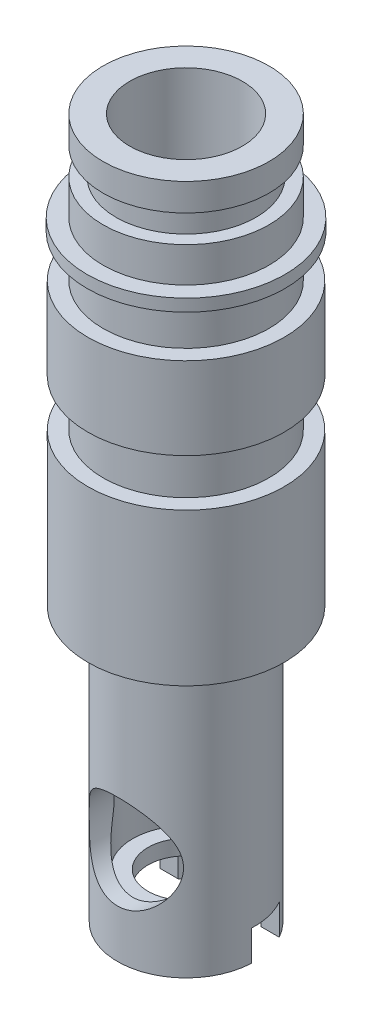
ISO-10303-21;
HEADER;
FILE_DESCRIPTION(('STEP AP214'),'2;1');
FILE_NAME('part.step','',(''),(''),'','','');
FILE_SCHEMA(('AUTOMOTIVE_DESIGN { 1 0 10303 214 1 1 1 1 }'));
ENDSEC;
DATA;
#1=APPLICATION_CONTEXT('core data for automotive mechanical design processes');
#2=APPLICATION_PROTOCOL_DEFINITION('international standard','automotive_design',2000,#1);
#3=PRODUCT_CONTEXT('',#1,'mechanical');
#4=PRODUCT('Part','Part','',(#3));
#5=PRODUCT_RELATED_PRODUCT_CATEGORY('part','',(#4));
#6=PRODUCT_DEFINITION_FORMATION('','',#4);
#7=PRODUCT_DEFINITION_CONTEXT('part definition',#1,'design');
#8=PRODUCT_DEFINITION('design','',#6,#7);
#9=PRODUCT_DEFINITION_SHAPE('','',#8);
#10=(LENGTH_UNIT() NAMED_UNIT(*) SI_UNIT(.MILLI.,.METRE.));
#11=(NAMED_UNIT(*) PLANE_ANGLE_UNIT() SI_UNIT($,.RADIAN.));
#12=(NAMED_UNIT(*) SI_UNIT($,.STERADIAN.) SOLID_ANGLE_UNIT());
#13=UNCERTAINTY_MEASURE_WITH_UNIT(LENGTH_MEASURE(1.E-05),#10,'distance_accuracy_value','');
#14=(GEOMETRIC_REPRESENTATION_CONTEXT(3) GLOBAL_UNCERTAINTY_ASSIGNED_CONTEXT((#13)) GLOBAL_UNIT_ASSIGNED_CONTEXT((#10,
#11,#12)) REPRESENTATION_CONTEXT('',''));
#15=CARTESIAN_POINT('',(0.,0.,0.));
#16=DIRECTION('',(0.,0.,1.));
#17=DIRECTION('',(1.,0.,0.));
#18=AXIS2_PLACEMENT_3D('',#15,#16,#17);
#19=CARTESIAN_POINT('',(0.,0.,0.));
#20=DIRECTION('',(0.,1.,0.));
#21=DIRECTION('',(0.,0.,1.));
#22=AXIS2_PLACEMENT_3D('',#19,#20,#21);
#23=CYLINDRICAL_SURFACE('',#22,4.44499999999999);
#24=CARTESIAN_POINT('',(0.,-54.4068,4.44499999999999));
#25=CARTESIAN_POINT('',(-0.0916092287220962,-54.4067991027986,4.4449991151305));
#26=CARTESIAN_POINT('',(-0.183254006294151,-54.4035952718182,4.44216074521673));
#27=CARTESIAN_POINT('',(-0.365794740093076,-54.3908390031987,4.43086835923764));
#28=CARTESIAN_POINT('',(-0.456690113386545,-54.3812820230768,4.4224103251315));
#29=CARTESIAN_POINT('',(-0.637146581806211,-54.3559712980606,4.40003952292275));
#30=CARTESIAN_POINT('',(-0.726704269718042,-54.3402038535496,4.38611469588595));
#31=CARTESIAN_POINT('',(-0.903623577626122,-54.3027660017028,4.35311473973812));
#32=CARTESIAN_POINT('',(-0.990984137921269,-54.281092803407,4.33403717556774));
#33=CARTESIAN_POINT('',(-1.24758042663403,-54.2081008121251,4.26994112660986));
#34=CARTESIAN_POINT('',(-1.412830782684,-54.148590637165,4.21786399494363));
#35=CARTESIAN_POINT('',(-1.72908214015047,-54.0109996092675,4.09841420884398));
#36=CARTESIAN_POINT('',(-1.88008481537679,-53.93292094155,4.03104335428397));
#37=CARTESIAN_POINT('',(-2.22292215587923,-53.7275025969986,3.85573955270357));
#38=CARTESIAN_POINT('',(-2.40758819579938,-53.5928460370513,3.74225417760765));
#39=CARTESIAN_POINT('',(-2.6614760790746,-53.3730969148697,3.5616662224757));
#40=CARTESIAN_POINT('',(-2.7423769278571,-53.2967344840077,3.499623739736));
#41=CARTESIAN_POINT('',(-2.89655898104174,-53.1385254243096,3.37311238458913));
#42=CARTESIAN_POINT('',(-2.96984273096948,-53.0566806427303,3.30864433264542));
#43=CARTESIAN_POINT('',(-3.11042126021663,-52.8859456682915,3.17691613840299));
#44=CARTESIAN_POINT('',(-3.17754501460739,-52.7969386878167,3.1096258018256));
#45=CARTESIAN_POINT('',(-3.30401148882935,-52.6136009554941,2.97490583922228));
#46=CARTESIAN_POINT('',(-3.36335188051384,-52.5192686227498,2.90747617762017));
#47=CARTESIAN_POINT('',(-3.47411235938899,-52.3253228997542,2.77417699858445));
#48=CARTESIAN_POINT('',(-3.52554715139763,-52.2257197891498,2.70830478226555));
#49=CARTESIAN_POINT('',(-3.62042784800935,-52.0206788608,2.58009207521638));
#50=CARTESIAN_POINT('',(-3.663879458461,-51.9152452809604,2.5177490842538));
#51=CARTESIAN_POINT('',(-3.74297125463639,-51.6961409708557,2.39861779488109));
#52=CARTESIAN_POINT('',(-3.77848597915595,-51.5823712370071,2.34192563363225));
#53=CARTESIAN_POINT('',(-3.83986338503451,-51.3473616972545,2.23987018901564));
#54=CARTESIAN_POINT('',(-3.86574132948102,-51.2261340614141,2.19448902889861));
#55=CARTESIAN_POINT('',(-3.90300830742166,-50.996758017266,2.12739307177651));
#56=CARTESIAN_POINT('',(-3.91606908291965,-50.8896881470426,2.10302990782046));
#57=CARTESIAN_POINT('',(-3.93328091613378,-50.672471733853,2.07067401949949));
#58=CARTESIAN_POINT('',(-3.93745009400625,-50.5623319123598,2.06264800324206));
#59=CARTESIAN_POINT('',(-3.93647106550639,-50.3420312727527,2.06451392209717));
#60=CARTESIAN_POINT('',(-3.93130404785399,-50.2318708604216,2.07444203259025));
#61=CARTESIAN_POINT('',(-3.91215743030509,-50.0149172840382,2.11031745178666));
#62=CARTESIAN_POINT('',(-3.89815920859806,-49.9081317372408,2.13629860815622));
#63=CARTESIAN_POINT('',(-3.85281075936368,-49.6438113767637,2.21742370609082));
#64=CARTESIAN_POINT('',(-3.81618069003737,-49.489775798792,2.28073506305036));
#65=CARTESIAN_POINT('',(-3.72761951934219,-49.1935095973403,2.42279325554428));
#66=CARTESIAN_POINT('',(-3.67562399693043,-49.0513319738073,2.50160460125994));
#67=CARTESIAN_POINT('',(-3.56625752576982,-48.7970700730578,2.65469706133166));
#68=CARTESIAN_POINT('',(-3.5107234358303,-48.6835924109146,2.72801001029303));
#69=CARTESIAN_POINT('',(-3.38977482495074,-48.4635150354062,2.87691851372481));
#70=CARTESIAN_POINT('',(-3.32435394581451,-48.3569198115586,2.95251551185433));
#71=CARTESIAN_POINT('',(-3.18373308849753,-48.1504483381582,3.10363038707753));
#72=CARTESIAN_POINT('',(-3.1085391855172,-48.0505679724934,3.17914828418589));
#73=CARTESIAN_POINT('',(-2.94829281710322,-47.8576642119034,3.32830022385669));
#74=CARTESIAN_POINT('',(-2.86324473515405,-47.7646377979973,3.40193508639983));
#75=CARTESIAN_POINT('',(-2.62918616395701,-47.5323700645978,3.5887753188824));
#76=CARTESIAN_POINT('',(-2.47232081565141,-47.3987263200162,3.69933598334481));
#77=CARTESIAN_POINT('',(-2.13300308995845,-47.1541007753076,3.90481366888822));
#78=CARTESIAN_POINT('',(-1.95059964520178,-47.0430766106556,3.99975986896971));
#79=CARTESIAN_POINT('',(-1.60148742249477,-46.8691076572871,4.14988369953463));
#80=CARTESIAN_POINT('',(-1.43921032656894,-46.8009731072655,4.2092235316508));
#81=CARTESIAN_POINT('',(-1.18639930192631,-46.7147521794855,4.28465292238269));
#82=CARTESIAN_POINT('',(-1.10053755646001,-46.6886702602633,4.30753719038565));
#83=CARTESIAN_POINT('',(-0.926150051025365,-46.6422233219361,4.34836468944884));
#84=CARTESIAN_POINT('',(-0.837625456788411,-46.6218558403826,4.36631004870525));
#85=CARTESIAN_POINT('',(-0.657884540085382,-46.5870697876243,4.39699698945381));
#86=CARTESIAN_POINT('',(-0.56665405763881,-46.5726924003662,4.40970253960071));
#87=CARTESIAN_POINT('',(-0.382840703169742,-46.5503651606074,4.42944672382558));
#88=CARTESIAN_POINT('',(-0.290258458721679,-46.54241241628,4.43648790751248));
#89=CARTESIAN_POINT('',(-0.104502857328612,-46.5330894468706,4.44474306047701));
#90=CARTESIAN_POINT('',(-0.011329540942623,-46.5317187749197,4.44595742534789));
#91=CARTESIAN_POINT('',(0.174742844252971,-46.5355771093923,4.44254054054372));
#92=CARTESIAN_POINT('',(0.267641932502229,-46.5408056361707,4.43790971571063));
#93=CARTESIAN_POINT('',(0.526195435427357,-46.564567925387,4.41688045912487));
#94=CARTESIAN_POINT('',(0.69074757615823,-46.590389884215,4.39404025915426));
#95=CARTESIAN_POINT('',(1.01205743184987,-46.6615361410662,4.33135687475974));
#96=CARTESIAN_POINT('',(1.16881350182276,-46.706864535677,4.29151011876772));
#97=CARTESIAN_POINT('',(1.47915998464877,-46.8173342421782,4.19497307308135));
#98=CARTESIAN_POINT('',(1.63220699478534,-46.8833473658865,4.13754486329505));
#99=CARTESIAN_POINT('',(1.92450275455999,-47.0313190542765,4.00996492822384));
#100=CARTESIAN_POINT('',(2.06374730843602,-47.1132824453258,3.93980935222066));
#101=CARTESIAN_POINT('',(2.39536235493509,-47.336105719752,3.75138112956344));
#102=CARTESIAN_POINT('',(2.57844455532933,-47.4856381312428,3.6268598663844));
#103=CARTESIAN_POINT('',(2.82798300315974,-47.7282593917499,3.43101261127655));
#104=CARTESIAN_POINT('',(2.90714112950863,-47.8124108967,3.36404774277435));
#105=CARTESIAN_POINT('',(3.05716640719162,-47.9864779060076,3.22830658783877));
#106=CARTESIAN_POINT('',(3.12803529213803,-48.0763921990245,3.1595306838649));
#107=CARTESIAN_POINT('',(3.26307577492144,-48.2639053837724,3.01993566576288));
#108=CARTESIAN_POINT('',(3.32705643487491,-48.3616332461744,2.94910587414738));
#109=CARTESIAN_POINT('',(3.44647596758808,-48.5631025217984,2.80861579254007));
#110=CARTESIAN_POINT('',(3.50190958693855,-48.6668475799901,2.73895624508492));
#111=CARTESIAN_POINT('',(3.60382507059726,-48.8803475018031,2.60338735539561));
#112=CARTESIAN_POINT('',(3.65034127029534,-48.9900771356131,2.53746434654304));
#113=CARTESIAN_POINT('',(3.73416368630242,-49.2165825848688,2.41240298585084));
#114=CARTESIAN_POINT('',(3.77148358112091,-49.333347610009,2.3532546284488));
#115=CARTESIAN_POINT('',(3.83221340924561,-49.560797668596,2.2528220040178));
#116=CARTESIAN_POINT('',(3.85673852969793,-49.6706014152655,2.2102584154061));
#117=CARTESIAN_POINT('',(3.89665104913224,-49.8961088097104,2.13911509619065));
#118=CARTESIAN_POINT('',(3.91206486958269,-50.0117943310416,2.11049497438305));
#119=CARTESIAN_POINT('',(3.93261642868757,-50.248944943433,2.07197760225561));
#120=CARTESIAN_POINT('',(3.93761581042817,-50.3704661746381,2.06233252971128));
#121=CARTESIAN_POINT('',(3.93626072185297,-50.6132287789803,2.06491453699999));
#122=CARTESIAN_POINT('',(3.92990219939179,-50.734470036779,2.07714942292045));
#123=CARTESIAN_POINT('',(3.90515504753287,-50.9874351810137,2.12332377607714));
#124=CARTESIAN_POINT('',(3.88533255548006,-51.1185180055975,2.15983773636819));
#125=CARTESIAN_POINT('',(3.834255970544,-51.3728003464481,2.24924977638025));
#126=CARTESIAN_POINT('',(3.80295736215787,-51.4959669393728,2.30221153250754));
#127=CARTESIAN_POINT('',(3.73430800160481,-51.7217208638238,2.41178658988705));
#128=CARTESIAN_POINT('',(3.69794898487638,-51.8251063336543,2.46741946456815));
#129=CARTESIAN_POINT('',(3.61787505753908,-52.0262963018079,2.58340409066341));
#130=CARTESIAN_POINT('',(3.57415439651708,-52.1240963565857,2.64375951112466));
#131=CARTESIAN_POINT('',(3.4795975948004,-52.3147119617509,2.76703367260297));
#132=CARTESIAN_POINT('',(3.42875113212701,-52.4075200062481,2.82995603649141));
#133=CARTESIAN_POINT('',(3.32010556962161,-52.5882862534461,2.95666933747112));
#134=CARTESIAN_POINT('',(3.2623084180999,-52.6762458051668,3.02046002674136));
#135=CARTESIAN_POINT('',(3.13441178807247,-52.8548603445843,3.15320404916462));
#136=CARTESIAN_POINT('',(3.0636803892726,-52.9450891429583,3.22212608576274));
#137=CARTESIAN_POINT('',(2.91390674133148,-53.1197745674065,3.35818941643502));
#138=CARTESIAN_POINT('',(2.8348628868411,-53.2042300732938,3.42533036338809));
#139=CARTESIAN_POINT('',(2.5853573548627,-53.4480295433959,3.62196210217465));
#140=CARTESIAN_POINT('',(2.40211492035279,-53.5983811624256,3.74710137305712));
#141=CARTESIAN_POINT('',(2.05241961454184,-53.8343442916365,3.94656606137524));
#142=CARTESIAN_POINT('',(1.89329485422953,-53.9267335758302,4.02576220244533));
#143=CARTESIAN_POINT('',(1.5574436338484,-54.0904564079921,4.16719233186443));
#144=CARTESIAN_POINT('',(1.38072798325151,-54.1618027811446,4.22943665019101));
#145=CARTESIAN_POINT('',(1.03783651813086,-54.2712024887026,4.3252889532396));
#146=CARTESIAN_POINT('',(0.87347126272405,-54.312454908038,4.36163249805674));
#147=CARTESIAN_POINT('',(0.622070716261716,-54.3582797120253,4.40207713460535));
#148=CARTESIAN_POINT('',(0.53753062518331,-54.3708753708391,4.41321030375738));
#149=CARTESIAN_POINT('',(0.367332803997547,-54.3905593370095,4.43061930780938));
#150=CARTESIAN_POINT('',(0.281675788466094,-54.3976510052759,4.43689810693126));
#151=CARTESIAN_POINT('',(0.163212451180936,-54.4035511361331,4.4421226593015));
#152=CARTESIAN_POINT('',(0.130594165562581,-54.4047688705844,4.44320108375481));
#153=CARTESIAN_POINT('',(0.065318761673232,-54.4063934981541,4.4446399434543));
#154=CARTESIAN_POINT('',(0.0326616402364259,-54.4068003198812,4.44500031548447));
#155=CARTESIAN_POINT('',(0.,-54.4068,4.44499999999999));
#156=B_SPLINE_CURVE_WITH_KNOTS('',3,(#24,#25,#26,#27,#28,#29,#30,#31,#32,#33,#34,#35,#36,#37,
#38,#39,#40,#41,#42,#43,#44,#45,#46,#47,#48,#49,#50,#51,#52,#53,#54,#55,#56,#57,#58,#59,#60,#61,
#62,#63,#64,#65,#66,#67,#68,#69,#70,#71,#72,#73,#74,#75,#76,#77,#78,#79,#80,#81,#82,#83,#84,#85,
#86,#87,#88,#89,#90,#91,#92,#93,#94,#95,#96,#97,#98,#99,#100,#101,#102,#103,#104,#105,#106,#107,
#108,#109,#110,#111,#112,#113,#114,#115,#116,#117,#118,#119,#120,#121,#122,#123,#124,#125,#126,
#127,#128,#129,#130,#131,#132,#133,#134,#135,#136,#137,#138,#139,#140,#141,#142,#143,#144,#145,
#146,#147,#148,#149,#150,#151,#152,#153,#154,#155),.UNSPECIFIED.,.T.,.F.,(4,2,2,2,2,2,2,2,2,2,2,
2,2,2,2,2,2,2,2,2,2,2,2,2,2,2,2,2,2,2,2,2,2,2,2,2,2,2,2,2,2,2,2,2,2,2,2,2,2,2,2,2,2,2,2,2,2,2,2,
2,2,2,2,2,2,4),(0.,0.274789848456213,0.549776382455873,0.82537293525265,1.10109995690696,
1.64802949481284,2.19489469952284,2.95592706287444,3.33780662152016,3.71955814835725,
4.10986507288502,4.5002884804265,4.8899766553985,5.27938521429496,5.67457133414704,
6.0691288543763,6.3995296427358,6.72925646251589,7.05964838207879,7.39073931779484,
7.89940810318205,8.41024053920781,8.84789996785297,9.28584206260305,9.72351321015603,
10.1609904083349,10.8598600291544,11.5574084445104,12.1121533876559,12.3896822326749,
12.6670913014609,12.9463773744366,13.2255376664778,13.5046790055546,13.7838000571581,
14.2856689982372,14.7876433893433,15.3145355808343,15.8415874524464,16.6384112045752,
17.0387477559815,17.4390004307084,17.8484352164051,18.2581206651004,18.6661955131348,
19.0736596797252,19.4335610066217,19.7924134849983,20.1560037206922,20.5197236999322,
20.9299364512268,21.3417575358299,21.7099730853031,22.078477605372,22.4475215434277,
22.8164622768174,23.2173519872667,23.6183192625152,24.417789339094,25.0166154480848,
25.615075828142,26.1325384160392,26.3908608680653,26.6490254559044,26.7469882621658,
26.8449596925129),.UNSPECIFIED.);
#157=CARTESIAN_POINT('',(0.,-54.4068,4.44499999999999));
#158=VERTEX_POINT('',#157);
#159=EDGE_CURVE('E208',#158,#158,#156,.T.);
#160=ORIENTED_EDGE('',*,*,#159,.F.);
#161=EDGE_LOOP('',(#160));
#162=FACE_BOUND('',#161,.T.);
#163=CARTESIAN_POINT('',(0.,-23.3593162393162,0.));
#164=DIRECTION('',(0.,1.,0.));
#165=DIRECTION('',(0.,0.,1.));
#166=AXIS2_PLACEMENT_3D('',#163,#164,#165);
#167=CIRCLE('',#166,4.445);
#168=CARTESIAN_POINT('',(0.,-23.3593162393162,4.445));
#169=VERTEX_POINT('',#168);
#170=EDGE_CURVE('E275',#169,#169,#167,.T.);
#171=ORIENTED_EDGE('',*,*,#170,.T.);
#172=EDGE_LOOP('',(#171));
#173=FACE_BOUND('',#172,.T.);
#174=CARTESIAN_POINT('',(1.27,-49.53,-4.25970949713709));
#175=CARTESIAN_POINT('',(1.26999874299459,-49.599755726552,-4.25971047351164));
#176=CARTESIAN_POINT('',(1.26423335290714,-49.6695241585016,-4.26144169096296));
#177=CARTESIAN_POINT('',(1.24137650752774,-49.807032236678,-4.26815497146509));
#178=CARTESIAN_POINT('',(1.22428044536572,-49.8747710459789,-4.2731383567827));
#179=CARTESIAN_POINT('',(1.1793813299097,-50.0062101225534,-4.28574650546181));
#180=CARTESIAN_POINT('',(1.1515948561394,-50.0699164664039,-4.29336717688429));
#181=CARTESIAN_POINT('',(1.08615711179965,-50.191776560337,-4.31038584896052));
#182=CARTESIAN_POINT('',(1.0485046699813,-50.24992965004,-4.31978406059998));
#183=CARTESIAN_POINT('',(0.963247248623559,-50.3607016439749,-4.33960132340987));
#184=CARTESIAN_POINT('',(0.915409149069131,-50.413137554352,-4.35004055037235));
#185=CARTESIAN_POINT('',(0.811638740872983,-50.5093622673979,-4.37059048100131));
#186=CARTESIAN_POINT('',(0.755705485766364,-50.553150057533,-4.38070114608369));
#187=CARTESIAN_POINT('',(0.636045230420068,-50.6316161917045,-4.3996821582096));
#188=CARTESIAN_POINT('',(0.572192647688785,-50.6661100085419,-4.4085259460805));
#189=CARTESIAN_POINT('',(0.439298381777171,-50.7238011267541,-4.42374363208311));
#190=CARTESIAN_POINT('',(0.370257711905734,-50.7470006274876,-4.43011801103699));
#191=CARTESIAN_POINT('',(0.230859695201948,-50.7808448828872,-4.43953594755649));
#192=CARTESIAN_POINT('',(0.160583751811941,-50.7918015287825,-4.44266210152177));
#193=CARTESIAN_POINT('',(0.0191262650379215,-50.8018330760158,-4.44552130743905));
#194=CARTESIAN_POINT('',(-0.0520551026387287,-50.8009102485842,-4.44525500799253));
#195=CARTESIAN_POINT('',(-0.191122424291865,-50.787422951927,-4.441418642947));
#196=CARTESIAN_POINT('',(-0.25904415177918,-50.7751958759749,-4.43794432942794));
#197=CARTESIAN_POINT('',(-0.391828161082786,-50.7399956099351,-4.42819717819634));
#198=CARTESIAN_POINT('',(-0.456690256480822,-50.7170217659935,-4.42192417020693));
#199=CARTESIAN_POINT('',(-0.582341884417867,-50.6607385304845,-4.40714785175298));
#200=CARTESIAN_POINT('',(-0.643079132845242,-50.6273188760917,-4.39862090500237));
#201=CARTESIAN_POINT('',(-0.758194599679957,-50.5511786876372,-4.38024758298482));
#202=CARTESIAN_POINT('',(-0.812571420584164,-50.5084561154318,-4.37040091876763));
#203=CARTESIAN_POINT('',(-0.915436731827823,-50.4131543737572,-4.35004008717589));
#204=CARTESIAN_POINT('',(-0.963651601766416,-50.3602819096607,-4.3395146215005));
#205=CARTESIAN_POINT('',(-1.05060306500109,-50.2470959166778,-4.31928888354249));
#206=CARTESIAN_POINT('',(-1.08933888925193,-50.1867817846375,-4.30958867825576));
#207=CARTESIAN_POINT('',(-1.15648318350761,-50.0597608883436,-4.29206136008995));
#208=CARTESIAN_POINT('',(-1.18480673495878,-49.9930069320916,-4.28424981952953));
#209=CARTESIAN_POINT('',(-1.22973434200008,-49.8554037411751,-4.27157225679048));
#210=CARTESIAN_POINT('',(-1.24634180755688,-49.784555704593,-4.26670537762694));
#211=CARTESIAN_POINT('',(-1.26687209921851,-49.6433599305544,-4.2606538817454));
#212=CARTESIAN_POINT('',(-1.27120744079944,-49.5730772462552,-4.25934956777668));
#213=CARTESIAN_POINT('',(-1.26821562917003,-49.432788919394,-4.2602414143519));
#214=CARTESIAN_POINT('',(-1.26088993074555,-49.3627832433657,-4.26243713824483));
#215=CARTESIAN_POINT('',(-1.23514981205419,-49.2266978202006,-4.26996498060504));
#216=CARTESIAN_POINT('',(-1.21699313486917,-49.1605648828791,-4.27522413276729));
#217=CARTESIAN_POINT('',(-1.17040127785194,-49.0322858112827,-4.28821255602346));
#218=CARTESIAN_POINT('',(-1.14196461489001,-48.9701402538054,-4.29594218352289));
#219=CARTESIAN_POINT('',(-1.07481347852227,-48.849900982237,-4.31323869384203));
#220=CARTESIAN_POINT('',(-1.03586211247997,-48.7919455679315,-4.3228463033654));
#221=CARTESIAN_POINT('',(-0.94907394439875,-48.6832425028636,-4.34272516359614));
#222=CARTESIAN_POINT('',(-0.901235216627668,-48.6324964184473,-4.35299655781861));
#223=CARTESIAN_POINT('',(-0.796104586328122,-48.537889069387,-4.37346551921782));
#224=CARTESIAN_POINT('',(-0.738547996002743,-48.4943181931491,-4.38364887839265));
#225=CARTESIAN_POINT('',(-0.616702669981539,-48.417450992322,-4.40244215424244));
#226=CARTESIAN_POINT('',(-0.552414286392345,-48.3841541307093,-4.41105215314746));
#227=CARTESIAN_POINT('',(-0.419375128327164,-48.3290979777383,-4.42567380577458));
#228=CARTESIAN_POINT('',(-0.350662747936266,-48.3072513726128,-4.43170505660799));
#229=CARTESIAN_POINT('',(-0.2103409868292,-48.275476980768,-4.44057620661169));
#230=CARTESIAN_POINT('',(-0.138732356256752,-48.2655461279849,-4.44341692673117));
#231=CARTESIAN_POINT('',(0.00265318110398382,-48.2581004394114,-4.44554187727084));
#232=CARTESIAN_POINT('',(0.0724062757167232,-48.2601624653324,-4.44494731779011));
#233=CARTESIAN_POINT('',(0.210531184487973,-48.2756453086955,-4.44054908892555));
#234=CARTESIAN_POINT('',(0.278903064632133,-48.2890655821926,-4.43674557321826));
#235=CARTESIAN_POINT('',(0.411736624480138,-48.3266314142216,-4.42638689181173));
#236=CARTESIAN_POINT('',(0.476227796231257,-48.3506800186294,-4.4198566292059));
#237=CARTESIAN_POINT('',(0.600295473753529,-48.4087336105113,-4.40472254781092));
#238=CARTESIAN_POINT('',(0.659871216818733,-48.4427401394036,-4.39611840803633));
#239=CARTESIAN_POINT('',(0.774340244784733,-48.5209198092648,-4.37742936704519));
#240=CARTESIAN_POINT('',(0.82904160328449,-48.5653652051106,-4.36730804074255));
#241=CARTESIAN_POINT('',(0.930351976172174,-48.6626592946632,-4.34685481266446));
#242=CARTESIAN_POINT('',(0.976958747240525,-48.7155103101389,-4.33652285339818));
#243=CARTESIAN_POINT('',(1.06197937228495,-48.8297835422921,-4.31650163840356));
#244=CARTESIAN_POINT('',(1.10014586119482,-48.8913944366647,-4.3068363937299));
#245=CARTESIAN_POINT('',(1.16552944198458,-49.0204263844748,-4.28960562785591));
#246=CARTESIAN_POINT('',(1.19275266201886,-49.0878441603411,-4.28203893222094));
#247=CARTESIAN_POINT('',(1.23252569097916,-49.2173600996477,-4.27074621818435));
#248=CARTESIAN_POINT('',(1.24654246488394,-49.2789783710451,-4.26664398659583));
#249=CARTESIAN_POINT('',(1.26527945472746,-49.4037277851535,-4.26112539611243));
#250=CARTESIAN_POINT('',(1.27000113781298,-49.4668586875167,-4.25970861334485));
#251=CARTESIAN_POINT('',(1.27,-49.53,-4.25970949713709));
#252=B_SPLINE_CURVE_WITH_KNOTS('',3,(#174,#175,#176,#177,#178,#179,#180,#181,#182,#183,#184,
#185,#186,#187,#188,#189,#190,#191,#192,#193,#194,#195,#196,#197,#198,#199,#200,#201,#202,#203,
#204,#205,#206,#207,#208,#209,#210,#211,#212,#213,#214,#215,#216,#217,#218,#219,#220,#221,#222,
#223,#224,#225,#226,#227,#228,#229,#230,#231,#232,#233,#234,#235,#236,#237,#238,#239,#240,#241,
#242,#243,#244,#245,#246,#247,#248,#249,#250,#251),.UNSPECIFIED.,.T.,.F.,(4,2,2,2,2,2,2,2,2,2,2,
2,2,2,2,2,2,2,2,2,2,2,2,2,2,2,2,2,2,2,2,2,2,2,2,2,2,2,4),(0.,0.209034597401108,
0.418154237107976,0.62695085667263,0.83577227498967,1.05001801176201,1.26428881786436,
1.48254391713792,1.70075649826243,1.9132734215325,2.12574971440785,2.33208218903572,
2.53842721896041,2.74702843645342,2.9556754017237,3.17164474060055,3.38763159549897,
3.60534280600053,3.82299062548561,4.03323020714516,4.24344356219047,4.44884358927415,
4.65427326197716,4.86478583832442,5.07534408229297,5.29301321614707,5.51067097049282,
5.72664390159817,5.94256124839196,6.15090780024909,6.35924437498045,6.56571846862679,
6.77222453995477,6.98487153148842,7.19757736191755,7.4158704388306,7.63404110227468,
7.82328438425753,8.01249779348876),.UNSPECIFIED.);
#253=CARTESIAN_POINT('',(1.27,-49.53,-4.25970949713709));
#254=VERTEX_POINT('',#253);
#255=EDGE_CURVE('E163',#254,#254,#252,.T.);
#256=ORIENTED_EDGE('',*,*,#255,.T.);
#257=EDGE_LOOP('',(#256));
#258=FACE_BOUND('',#257,.T.);
#259=CARTESIAN_POINT('',(0.,-54.61,0.));
#260=DIRECTION('',(0.,-1.,0.));
#261=DIRECTION('',(0.,0.,-1.));
#262=AXIS2_PLACEMENT_3D('',#259,#260,#261);
#263=CIRCLE('',#262,4.44499999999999);
#264=CARTESIAN_POINT('',(0.,-54.61,-4.44499999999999));
#265=VERTEX_POINT('',#264);
#266=EDGE_CURVE('E11',#265,#265,#263,.F.);
#267=ORIENTED_EDGE('',*,*,#266,.F.);
#268=EDGE_LOOP('',(#267));
#269=FACE_BOUND('',#268,.T.);
#270=ADVANCED_FACE('F28',(#162,#173,#258,#269),#23,.F.);
#271=DIRECTION('',(0.,1.,0.));
#272=VECTOR('',#271,1.);
#273=CARTESIAN_POINT('',(-4.43773692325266,0.,0.253999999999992));
#274=LINE('',#273,#272);
#275=CARTESIAN_POINT('',(-4.43773692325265,-58.42,0.254));
#276=VERTEX_POINT('',#275);
#277=CARTESIAN_POINT('',(-4.43773692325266,-55.88,0.253999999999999));
#278=VERTEX_POINT('',#277);
#279=EDGE_CURVE('E51',#276,#278,#274,.T.);
#280=ORIENTED_EDGE('',*,*,#279,.T.);
#281=CARTESIAN_POINT('',(0.,-55.88,0.));
#282=DIRECTION('',(0.,-1.,0.));
#283=DIRECTION('',(0.,0.,-1.));
#284=AXIS2_PLACEMENT_3D('',#281,#282,#283);
#285=CIRCLE('',#284,4.44499999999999);
#286=CARTESIAN_POINT('',(4.43773692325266,-55.88,0.253999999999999));
#287=VERTEX_POINT('',#286);
#288=EDGE_CURVE('E109',#287,#278,#285,.T.);
#289=ORIENTED_EDGE('',*,*,#288,.F.);
#290=DIRECTION('',(0.,1.,0.));
#291=VECTOR('',#290,1.);
#292=CARTESIAN_POINT('',(4.43773692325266,0.,0.253999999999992));
#293=LINE('',#292,#291);
#294=CARTESIAN_POINT('',(4.43773692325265,-58.42,0.254));
#295=VERTEX_POINT('',#294);
#296=EDGE_CURVE('E113',#287,#295,#293,.F.);
#297=ORIENTED_EDGE('',*,*,#296,.T.);
#298=CARTESIAN_POINT('',(0.,-58.42,0.));
#299=DIRECTION('',(0.,1.,0.));
#300=DIRECTION('',(0.,0.,1.));
#301=AXIS2_PLACEMENT_3D('',#298,#299,#300);
#302=CIRCLE('',#301,4.44499999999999);
#303=EDGE_CURVE('E279',#276,#295,#302,.T.);
#304=ORIENTED_EDGE('',*,*,#303,.F.);
#305=EDGE_LOOP('',(#280,#289,#297,#304));
#306=FACE_BOUND('',#305,.T.);
#307=ADVANCED_FACE('F111',(#306),#23,.F.);
#308=CARTESIAN_POINT('',(8.19150000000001,-35.56,0.));
#309=DIRECTION('',(0.,-1.,0.));
#310=DIRECTION('',(0.,0.,-1.));
#311=AXIS2_PLACEMENT_3D('',#308,#309,#310);
#312=PLANE('',#311);
#313=CARTESIAN_POINT('',(0.,-35.56,0.));
#314=DIRECTION('',(0.,1.,0.));
#315=DIRECTION('',(0.,0.,1.));
#316=AXIS2_PLACEMENT_3D('',#313,#314,#315);
#317=CIRCLE('',#316,8.19150000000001);
#318=CARTESIAN_POINT('',(-5.86851320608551,-35.56,-5.71500000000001));
#319=VERTEX_POINT('',#318);
#320=CARTESIAN_POINT('',(5.86851320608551,-35.56,-5.71500000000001));
#321=VERTEX_POINT('',#320);
#322=EDGE_CURVE('E227',#319,#321,#317,.T.);
#323=ORIENTED_EDGE('',*,*,#322,.F.);
#324=DIRECTION('',(1.,0.,0.));
#325=VECTOR('',#324,1.);
#326=CARTESIAN_POINT('',(-8.19150000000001,-35.56,-5.71500000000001));
#327=LINE('',#326,#325);
#328=CARTESIAN_POINT('',(0.,-35.56,-5.71500000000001));
#329=VERTEX_POINT('',#328);
#330=EDGE_CURVE('E354',#319,#329,#327,.T.);
#331=ORIENTED_EDGE('',*,*,#330,.T.);
#332=CARTESIAN_POINT('',(0.,-35.56,0.));
#333=DIRECTION('',(0.,1.,0.));
#334=DIRECTION('',(0.,0.,1.));
#335=AXIS2_PLACEMENT_3D('',#332,#333,#334);
#336=CIRCLE('',#335,5.71500000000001);
#337=EDGE_CURVE('E224',#329,#329,#336,.T.);
#338=ORIENTED_EDGE('',*,*,#337,.T.);
#339=EDGE_CURVE('E118',#329,#321,#327,.T.);
#340=ORIENTED_EDGE('',*,*,#339,.T.);
#341=EDGE_LOOP('',(#323,#331,#338,#340));
#342=FACE_BOUND('',#341,.T.);
#343=ADVANCED_FACE('F390',(#342),#312,.T.);
#344=CARTESIAN_POINT('',(0.,0.,0.));
#345=DIRECTION('',(0.,1.,0.));
#346=DIRECTION('',(0.,0.,1.));
#347=AXIS2_PLACEMENT_3D('',#344,#345,#346);
#348=CYLINDRICAL_SURFACE('',#347,8.19150000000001);
#349=CARTESIAN_POINT('',(0.,-22.86,0.));
#350=DIRECTION('',(0.,1.,0.));
#351=DIRECTION('',(0.,0.,1.));
#352=AXIS2_PLACEMENT_3D('',#349,#350,#351);
#353=CIRCLE('',#352,8.19150000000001);
#354=CARTESIAN_POINT('',(0.,-22.86,8.19150000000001));
#355=VERTEX_POINT('',#354);
#356=EDGE_CURVE('E230',#355,#355,#353,.T.);
#357=ORIENTED_EDGE('',*,*,#356,.F.);
#358=EDGE_LOOP('',(#357));
#359=FACE_BOUND('',#358,.T.);
#360=CARTESIAN_POINT('',(0.,-33.02,0.));
#361=DIRECTION('',(0.,1.,0.));
#362=DIRECTION('',(0.,0.,1.));
#363=AXIS2_PLACEMENT_3D('',#360,#361,#362);
#364=CIRCLE('',#363,8.19150000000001);
#365=CARTESIAN_POINT('',(-5.86851320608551,-33.02,-5.71500000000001));
#366=VERTEX_POINT('',#365);
#367=CARTESIAN_POINT('',(5.86851320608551,-33.02,-5.71500000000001));
#368=VERTEX_POINT('',#367);
#369=EDGE_CURVE('E344',#366,#368,#364,.F.);
#370=ORIENTED_EDGE('',*,*,#369,.F.);
#371=DIRECTION('',(0.,1.,0.));
#372=VECTOR('',#371,1.);
#373=CARTESIAN_POINT('',(-5.86851320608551,0.,-5.71500000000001));
#374=LINE('',#373,#372);
#375=EDGE_CURVE('E36',#366,#319,#374,.F.);
#376=ORIENTED_EDGE('',*,*,#375,.T.);
#377=ORIENTED_EDGE('',*,*,#322,.T.);
#378=DIRECTION('',(0.,1.,0.));
#379=VECTOR('',#378,1.);
#380=CARTESIAN_POINT('',(5.86851320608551,0.,-5.71500000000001));
#381=LINE('',#380,#379);
#382=EDGE_CURVE('E362',#321,#368,#381,.T.);
#383=ORIENTED_EDGE('',*,*,#382,.T.);
#384=EDGE_LOOP('',(#370,#376,#377,#383));
#385=FACE_BOUND('',#384,.T.);
#386=ADVANCED_FACE('F365',(#359,#385),#348,.T.);
#387=CARTESIAN_POINT('',(5.715,-58.42,0.));
#388=DIRECTION('',(0.,-1.,0.));
#389=DIRECTION('',(0.,0.,-1.));
#390=AXIS2_PLACEMENT_3D('',#387,#388,#389);
#391=PLANE('',#390);
#392=DIRECTION('',(1.,0.,0.));
#393=VECTOR('',#392,1.);
#394=CARTESIAN_POINT('',(5.715,-58.42,-2.794));
#395=LINE('',#394,#393);
#396=CARTESIAN_POINT('',(-4.98545775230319,-58.42,-2.794));
#397=VERTEX_POINT('',#396);
#398=CARTESIAN_POINT('',(-3.4571070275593,-58.42,-2.794));
#399=VERTEX_POINT('',#398);
#400=EDGE_CURVE('E334',#397,#399,#395,.T.);
#401=ORIENTED_EDGE('',*,*,#400,.F.);
#402=CARTESIAN_POINT('',(0.,-58.42,0.));
#403=DIRECTION('',(0.,1.,0.));
#404=DIRECTION('',(0.,0.,1.));
#405=AXIS2_PLACEMENT_3D('',#402,#403,#404);
#406=CIRCLE('',#405,5.715);
#407=CARTESIAN_POINT('',(4.98545775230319,-58.42,-2.794));
#408=VERTEX_POINT('',#407);
#409=EDGE_CURVE('E220',#408,#397,#406,.T.);
#410=ORIENTED_EDGE('',*,*,#409,.F.);
#411=CARTESIAN_POINT('',(3.4571070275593,-58.42,-2.794));
#412=VERTEX_POINT('',#411);
#413=EDGE_CURVE('E345',#412,#408,#395,.T.);
#414=ORIENTED_EDGE('',*,*,#413,.F.);
#415=EDGE_CURVE('E278',#412,#399,#302,.T.);
#416=ORIENTED_EDGE('',*,*,#415,.T.);
#417=EDGE_LOOP('',(#401,#410,#414,#416));
#418=FACE_BOUND('',#417,.T.);
#419=ADVANCED_FACE('F341',(#418),#391,.T.);
#420=CARTESIAN_POINT('',(0.,0.,0.));
#421=DIRECTION('',(0.,1.,0.));
#422=DIRECTION('',(0.,0.,1.));
#423=AXIS2_PLACEMENT_3D('',#420,#421,#422);
#424=CYLINDRICAL_SURFACE('',#423,5.71500000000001);
#425=DIRECTION('',(0.,1.,0.));
#426=VECTOR('',#425,1.);
#427=CARTESIAN_POINT('',(-4.9854577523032,0.,-2.79399999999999));
#428=LINE('',#427,#426);
#429=CARTESIAN_POINT('',(-4.9854577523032,-55.88,-2.794));
#430=VERTEX_POINT('',#429);
#431=EDGE_CURVE('E152',#430,#397,#428,.F.);
#432=ORIENTED_EDGE('',*,*,#431,.F.);
#433=CARTESIAN_POINT('',(0.,-55.88,0.));
#434=DIRECTION('',(0.,-1.,0.));
#435=DIRECTION('',(0.,0.,-1.));
#436=AXIS2_PLACEMENT_3D('',#433,#434,#435);
#437=CIRCLE('',#436,5.71500000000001);
#438=CARTESIAN_POINT('',(-5.70935276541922,-55.88,0.253999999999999));
#439=VERTEX_POINT('',#438);
#440=EDGE_CURVE('E155',#430,#439,#437,.F.);
#441=ORIENTED_EDGE('',*,*,#440,.T.);
#442=DIRECTION('',(0.,1.,0.));
#443=VECTOR('',#442,1.);
#444=CARTESIAN_POINT('',(-5.70935276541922,0.,0.253999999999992));
#445=LINE('',#444,#443);
#446=CARTESIAN_POINT('',(-5.70935276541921,-58.42,0.254));
#447=VERTEX_POINT('',#446);
#448=EDGE_CURVE('E124',#447,#439,#445,.T.);
#449=ORIENTED_EDGE('',*,*,#448,.F.);
#450=CARTESIAN_POINT('',(5.70935276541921,-58.42,0.254));
#451=VERTEX_POINT('',#450);
#452=EDGE_CURVE('E221',#447,#451,#406,.T.);
#453=ORIENTED_EDGE('',*,*,#452,.T.);
#454=DIRECTION('',(0.,1.,0.));
#455=VECTOR('',#454,1.);
#456=CARTESIAN_POINT('',(5.70935276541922,0.,0.253999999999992));
#457=LINE('',#456,#455);
#458=CARTESIAN_POINT('',(5.70935276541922,-55.88,0.253999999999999));
#459=VERTEX_POINT('',#458);
#460=EDGE_CURVE('E43',#459,#451,#457,.F.);
#461=ORIENTED_EDGE('',*,*,#460,.F.);
#462=CARTESIAN_POINT('',(4.9854577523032,-55.88,-2.794));
#463=VERTEX_POINT('',#462);
#464=EDGE_CURVE('E131',#459,#463,#437,.F.);
#465=ORIENTED_EDGE('',*,*,#464,.T.);
#466=DIRECTION('',(0.,1.,0.));
#467=VECTOR('',#466,1.);
#468=CARTESIAN_POINT('',(4.9854577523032,0.,-2.79399999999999));
#469=LINE('',#468,#467);
#470=EDGE_CURVE('E150',#408,#463,#469,.T.);
#471=ORIENTED_EDGE('',*,*,#470,.F.);
#472=ORIENTED_EDGE('',*,*,#409,.T.);
#473=EDGE_LOOP('',(#432,#441,#449,#453,#461,#465,#471,#472));
#474=FACE_BOUND('',#473,.T.);
#475=CARTESIAN_POINT('',(1.27,-49.53,-5.572102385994));
#476=CARTESIAN_POINT('',(1.2699976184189,-49.6003849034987,-5.57210380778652));
#477=CARTESIAN_POINT('',(1.26412887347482,-49.6707981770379,-5.57345053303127));
#478=CARTESIAN_POINT('',(1.24083587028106,-49.8096202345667,-5.5786816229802));
#479=CARTESIAN_POINT('',(1.22340343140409,-49.8780275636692,-5.58256778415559));
#480=CARTESIAN_POINT('',(1.17756075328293,-50.0108095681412,-5.59241637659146));
#481=CARTESIAN_POINT('',(1.14916278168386,-50.0751886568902,-5.5983764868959));
#482=CARTESIAN_POINT('',(1.08223052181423,-50.1982708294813,-5.61169862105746));
#483=CARTESIAN_POINT('',(1.04369637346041,-50.2569739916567,-5.61906062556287));
#484=CARTESIAN_POINT('',(0.956869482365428,-50.3680619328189,-5.63450043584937));
#485=CARTESIAN_POINT('',(0.908433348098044,-50.420333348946,-5.64258764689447));
#486=CARTESIAN_POINT('',(0.803486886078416,-50.5160805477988,-5.65848438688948));
#487=CARTESIAN_POINT('',(0.746975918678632,-50.5595556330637,-5.66629389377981));
#488=CARTESIAN_POINT('',(0.626722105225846,-50.636926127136,-5.68085790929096));
#489=CARTESIAN_POINT('',(0.562907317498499,-50.6707122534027,-5.68760002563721));
#490=CARTESIAN_POINT('',(0.430330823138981,-50.7270383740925,-5.69916325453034));
#491=CARTESIAN_POINT('',(0.361569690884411,-50.7495796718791,-5.70398458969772));
#492=CARTESIAN_POINT('',(0.222231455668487,-50.7824190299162,-5.71109655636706));
#493=CARTESIAN_POINT('',(0.151701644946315,-50.7929090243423,-5.71342681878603));
#494=CARTESIAN_POINT('',(0.00984736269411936,-50.801948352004,-5.71543147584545));
#495=CARTESIAN_POINT('',(-0.0614770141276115,-50.800499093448,-5.7151061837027));
#496=CARTESIAN_POINT('',(-0.201571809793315,-50.785843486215,-5.71186658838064));
#497=CARTESIAN_POINT('',(-0.270365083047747,-50.7728440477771,-5.70899785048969));
#498=CARTESIAN_POINT('',(-0.404768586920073,-50.7357871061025,-5.70104573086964));
#499=CARTESIAN_POINT('',(-0.470378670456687,-50.7117290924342,-5.69596224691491));
#500=CARTESIAN_POINT('',(-0.597124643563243,-50.6530565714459,-5.68407892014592));
#501=CARTESIAN_POINT('',(-0.658223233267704,-50.6183641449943,-5.67726647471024));
#502=CARTESIAN_POINT('',(-0.773806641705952,-50.5394657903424,-5.66267137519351));
#503=CARTESIAN_POINT('',(-0.828290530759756,-50.4952585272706,-5.65488858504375));
#504=CARTESIAN_POINT('',(-0.930328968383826,-50.3974606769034,-5.63901060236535));
#505=CARTESIAN_POINT('',(-0.977709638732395,-50.3436890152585,-5.63091229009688));
#506=CARTESIAN_POINT('',(-1.06281412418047,-50.2288792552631,-5.61547214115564));
#507=CARTESIAN_POINT('',(-1.10053766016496,-50.1678409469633,-5.60813032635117));
#508=CARTESIAN_POINT('',(-1.16533781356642,-50.0399431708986,-5.59502585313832));
#509=CARTESIAN_POINT('',(-1.19238063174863,-49.973066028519,-5.5892682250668));
#510=CARTESIAN_POINT('',(-1.23479096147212,-49.8355580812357,-5.58005306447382));
#511=CARTESIAN_POINT('',(-1.25016039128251,-49.7649278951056,-5.57659515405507));
#512=CARTESIAN_POINT('',(-1.26851599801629,-49.6235101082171,-5.5724482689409));
#513=CARTESIAN_POINT('',(-1.27175576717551,-49.5527570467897,-5.57170259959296));
#514=CARTESIAN_POINT('',(-1.2664474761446,-49.4117217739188,-5.57291153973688));
#515=CARTESIAN_POINT('',(-1.25790025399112,-49.3414395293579,-5.5748659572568));
#516=CARTESIAN_POINT('',(-1.22948088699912,-49.2042300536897,-5.58120123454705));
#517=CARTESIAN_POINT('',(-1.20974924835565,-49.1372722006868,-5.58555197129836));
#518=CARTESIAN_POINT('',(-1.1596736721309,-49.0076130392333,-5.59616234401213));
#519=CARTESIAN_POINT('',(-1.12932869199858,-48.9449121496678,-5.60242216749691));
#520=CARTESIAN_POINT('',(-1.05833208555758,-48.824451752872,-5.61626940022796));
#521=CARTESIAN_POINT('',(-1.01752472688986,-48.7667863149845,-5.62387627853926));
#522=CARTESIAN_POINT('',(-0.92696477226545,-48.6590286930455,-5.63950956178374));
#523=CARTESIAN_POINT('',(-0.877211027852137,-48.6089374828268,-5.64753602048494));
#524=CARTESIAN_POINT('',(-0.769021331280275,-48.516761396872,-5.66329153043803));
#525=CARTESIAN_POINT('',(-0.710436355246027,-48.4748496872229,-5.67101185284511));
#526=CARTESIAN_POINT('',(-0.586910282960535,-48.4014626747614,-5.68512268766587));
#527=CARTESIAN_POINT('',(-0.521969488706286,-48.3699868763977,-5.69151326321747));
#528=CARTESIAN_POINT('',(-0.387986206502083,-48.3186040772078,-5.70220785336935));
#529=CARTESIAN_POINT('',(-0.318973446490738,-48.2986224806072,-5.70652529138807));
#530=CARTESIAN_POINT('',(-0.178463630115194,-48.2705631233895,-5.71264527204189));
#531=CARTESIAN_POINT('',(-0.106966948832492,-48.2624835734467,-5.71444819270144));
#532=CARTESIAN_POINT('',(0.0348391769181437,-48.2585402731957,-5.71532432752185));
#533=CARTESIAN_POINT('',(0.105141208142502,-48.2624183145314,-5.71445524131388));
#534=CARTESIAN_POINT('',(0.244064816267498,-48.2817010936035,-5.71020909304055));
#535=CARTESIAN_POINT('',(0.312686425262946,-48.2971056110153,-5.70683207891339));
#536=CARTESIAN_POINT('',(0.446094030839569,-48.3388786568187,-5.69795429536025));
#537=CARTESIAN_POINT('',(0.510892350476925,-48.3652094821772,-5.69246083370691));
#538=CARTESIAN_POINT('',(0.635185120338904,-48.4280513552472,-5.67993585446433));
#539=CARTESIAN_POINT('',(0.694679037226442,-48.4645634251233,-5.67290418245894));
#540=CARTESIAN_POINT('',(0.807930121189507,-48.5475675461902,-5.65789751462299));
#541=CARTESIAN_POINT('',(0.861552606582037,-48.5942405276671,-5.64990678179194));
#542=CARTESIAN_POINT('',(0.960292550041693,-48.695878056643,-5.63396579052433));
#543=CARTESIAN_POINT('',(1.00540794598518,-48.7508446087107,-5.62601554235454));
#544=CARTESIAN_POINT('',(1.08645865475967,-48.8684281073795,-5.61093220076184));
#545=CARTESIAN_POINT('',(1.12225763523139,-48.9311407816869,-5.60381200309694));
#546=CARTESIAN_POINT('',(1.18275116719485,-49.0618379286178,-5.59135813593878));
#547=CARTESIAN_POINT('',(1.2074549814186,-49.1298179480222,-5.58602297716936));
#548=CARTESIAN_POINT('',(1.24072236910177,-49.2532076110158,-5.57871389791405));
#549=CARTESIAN_POINT('',(1.25168013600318,-49.3079553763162,-5.57625125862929));
#550=CARTESIAN_POINT('',(1.26631970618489,-49.4184628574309,-5.57294498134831));
#551=CARTESIAN_POINT('',(1.27000188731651,-49.4742225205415,-5.57210125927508));
#552=CARTESIAN_POINT('',(1.27,-49.53,-5.572102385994));
#553=B_SPLINE_CURVE_WITH_KNOTS('',3,(#475,#476,#477,#478,#479,#480,#481,#482,#483,#484,#485,
#486,#487,#488,#489,#490,#491,#492,#493,#494,#495,#496,#497,#498,#499,#500,#501,#502,#503,#504,
#505,#506,#507,#508,#509,#510,#511,#512,#513,#514,#515,#516,#517,#518,#519,#520,#521,#522,#523,
#524,#525,#526,#527,#528,#529,#530,#531,#532,#533,#534,#535,#536,#537,#538,#539,#540,#541,#542,
#543,#544,#545,#546,#547,#548,#549,#550,#551,#552),.UNSPECIFIED.,.T.,.F.,(4,2,2,2,2,2,2,2,2,2,2,
2,2,2,2,2,2,2,2,2,2,2,2,2,2,2,2,2,2,2,2,2,2,2,2,2,2,2,4),(0.,0.210950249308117,
0.422049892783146,0.632914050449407,0.843775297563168,1.05793917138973,1.27212001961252,
1.48862931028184,1.70511349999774,1.91809986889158,2.13106111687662,2.34028260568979,
2.54951375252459,2.76031615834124,2.97114815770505,3.18650650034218,3.40187106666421,
3.61791179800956,3.83391702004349,4.04538020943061,4.25682836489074,4.46567723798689,
4.67454663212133,4.88672650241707,5.09893362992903,5.31523604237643,5.53152818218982,
5.74640030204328,5.96124011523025,6.17147348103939,6.38170282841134,6.59121269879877,
6.80074361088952,7.0143653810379,7.22803886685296,7.44468266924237,7.66114527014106,
7.82832436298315,7.99549477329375),.UNSPECIFIED.);
#554=CARTESIAN_POINT('',(1.27,-49.53,-5.572102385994));
#555=VERTEX_POINT('',#554);
#556=EDGE_CURVE('E156',#555,#555,#553,.T.);
#557=ORIENTED_EDGE('',*,*,#556,.F.);
#558=EDGE_LOOP('',(#557));
#559=FACE_BOUND('',#558,.T.);
#560=ORIENTED_EDGE('',*,*,#337,.F.);
#561=EDGE_LOOP('',(#560));
#562=FACE_BOUND('',#561,.T.);
#563=CARTESIAN_POINT('',(0.,-54.4068,5.71500000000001));
#564=CARTESIAN_POINT('',(-0.196423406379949,-54.4067974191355,5.71499789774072));
#565=CARTESIAN_POINT('',(-0.392858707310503,-54.3920160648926,5.70478548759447));
#566=CARTESIAN_POINT('',(-0.779421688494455,-54.3338304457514,5.66494004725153));
#567=CARTESIAN_POINT('',(-0.969546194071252,-54.2904119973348,5.63529739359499));
#568=CARTESIAN_POINT('',(-1.33729988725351,-54.1776896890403,5.55949432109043));
#569=CARTESIAN_POINT('',(-1.51498481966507,-54.1085114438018,5.51341410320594));
#570=CARTESIAN_POINT('',(-1.85541430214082,-53.9472873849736,5.40836733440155));
#571=CARTESIAN_POINT('',(-2.01815684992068,-53.8552385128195,5.34939906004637));
#572=CARTESIAN_POINT('',(-2.3401191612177,-53.642224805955,5.21708302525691));
#573=CARTESIAN_POINT('',(-2.49779297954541,-53.5194379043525,5.14292959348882));
#574=CARTESIAN_POINT('',(-2.79178882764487,-53.2528459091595,4.98945533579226));
#575=CARTESIAN_POINT('',(-2.92807867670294,-53.1090097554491,4.91012697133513));
#576=CARTESIAN_POINT('',(-3.12595250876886,-52.8659973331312,4.78509493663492));
#577=CARTESIAN_POINT('',(-3.19508268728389,-52.7730286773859,4.73908610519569));
#578=CARTESIAN_POINT('',(-3.32521449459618,-52.5808210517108,4.64870515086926));
#579=CARTESIAN_POINT('',(-3.38621410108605,-52.4815805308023,4.60433343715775));
#580=CARTESIAN_POINT('',(-3.55622526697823,-52.1749944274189,4.47599400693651));
#581=CARTESIAN_POINT('',(-3.6526488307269,-51.9582968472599,4.39653663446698));
#582=CARTESIAN_POINT('',(-3.78293336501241,-51.5730806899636,4.28435572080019));
#583=CARTESIAN_POINT('',(-3.82690263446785,-51.4099494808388,4.24476836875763));
#584=CARTESIAN_POINT('',(-3.89371559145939,-51.0762372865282,4.18357393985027));
#585=CARTESIAN_POINT('',(-3.91659881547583,-50.9056708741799,4.16193322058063));
#586=CARTESIAN_POINT('',(-3.93976148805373,-50.5606921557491,4.14002457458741));
#587=CARTESIAN_POINT('',(-3.93992449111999,-50.3862646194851,4.13986675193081));
#588=CARTESIAN_POINT('',(-3.91733802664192,-50.0402059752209,4.16123713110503));
#589=CARTESIAN_POINT('',(-3.89457223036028,-49.8685769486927,4.18278078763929));
#590=CARTESIAN_POINT('',(-3.82971835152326,-49.5428532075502,4.24219697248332));
#591=CARTESIAN_POINT('',(-3.78883375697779,-49.388319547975,4.27904462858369));
#592=CARTESIAN_POINT('',(-3.69003545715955,-49.0882759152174,4.36453190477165));
#593=CARTESIAN_POINT('',(-3.63210837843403,-48.9427731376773,4.4131807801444));
#594=CARTESIAN_POINT('',(-3.46739161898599,-48.5904840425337,4.54470591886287));
#595=CARTESIAN_POINT('',(-3.35072063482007,-48.3900452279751,4.63242736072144));
#596=CARTESIAN_POINT('',(-3.15212665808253,-48.108163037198,4.76779126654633));
#597=CARTESIAN_POINT('',(-3.08188402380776,-48.0172190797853,4.81360876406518));
#598=CARTESIAN_POINT('',(-2.9337138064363,-47.8417846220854,4.90531518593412));
#599=CARTESIAN_POINT('',(-2.8557861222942,-47.7572942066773,4.95120411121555));
#600=CARTESIAN_POINT('',(-2.69168941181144,-47.5943372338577,5.04231460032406));
#601=CARTESIAN_POINT('',(-2.6054448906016,-47.515940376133,5.08752469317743));
#602=CARTESIAN_POINT('',(-2.42564915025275,-47.3666002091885,5.17566159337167));
#603=CARTESIAN_POINT('',(-2.33209885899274,-47.2956559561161,5.21858868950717));
#604=CARTESIAN_POINT('',(-2.13815649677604,-47.1619155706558,5.30099861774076));
#605=CARTESIAN_POINT('',(-2.03777623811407,-47.0991058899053,5.34048713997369));
#606=CARTESIAN_POINT('',(-1.83054993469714,-46.9822196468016,5.41502087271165));
#607=CARTESIAN_POINT('',(-1.72370584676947,-46.9281404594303,5.45006741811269));
#608=CARTESIAN_POINT('',(-1.44304981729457,-46.802024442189,5.53267040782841));
#609=CARTESIAN_POINT('',(-1.26498225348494,-46.7366795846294,5.57637418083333));
#610=CARTESIAN_POINT('',(-0.898278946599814,-46.631911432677,5.64704780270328));
#611=CARTESIAN_POINT('',(-0.70965046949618,-46.592470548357,5.67402900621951));
#612=CARTESIAN_POINT('',(-0.326137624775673,-46.5415532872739,5.70894262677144));
#613=CARTESIAN_POINT('',(-0.131232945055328,-46.5301794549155,5.71680519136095));
#614=CARTESIAN_POINT('',(0.257885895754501,-46.5364392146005,5.71249308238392));
#615=CARTESIAN_POINT('',(0.452100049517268,-46.5540731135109,5.70031819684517));
#616=CARTESIAN_POINT('',(0.822509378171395,-46.615368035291,5.65839603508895));
#617=CARTESIAN_POINT('',(0.999094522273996,-46.6574491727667,5.62971634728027));
#618=CARTESIAN_POINT('',(1.34211973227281,-46.7642660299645,5.55793826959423));
#619=CARTESIAN_POINT('',(1.50855791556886,-46.8290059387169,5.5148372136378));
#620=CARTESIAN_POINT('',(1.84065449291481,-46.9843862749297,5.41346738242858));
#621=CARTESIAN_POINT('',(2.00527974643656,-47.0766288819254,5.35429069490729));
#622=CARTESIAN_POINT('',(2.31735507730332,-47.2815803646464,5.22681171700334));
#623=CARTESIAN_POINT('',(2.46479294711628,-47.3943036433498,5.15850301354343));
#624=CARTESIAN_POINT('',(2.7646267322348,-47.6585291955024,5.005096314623));
#625=CARTESIAN_POINT('',(2.91363376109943,-47.8133658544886,4.91911412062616));
#626=CARTESIAN_POINT('',(3.18491656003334,-48.1455153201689,4.74797354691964));
#627=CARTESIAN_POINT('',(3.30717636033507,-48.3228414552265,4.66281568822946));
#628=CARTESIAN_POINT('',(3.50953573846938,-48.6755648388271,4.51201949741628));
#629=CARTESIAN_POINT('',(3.59295533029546,-48.8485708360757,4.44526689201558));
#630=CARTESIAN_POINT('',(3.73477060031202,-49.2093093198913,4.32680997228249));
#631=CARTESIAN_POINT('',(3.79321550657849,-49.3970119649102,4.27507611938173));
#632=CARTESIAN_POINT('',(3.87383926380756,-49.7488655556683,4.20202674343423));
#633=CARTESIAN_POINT('',(3.90066412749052,-49.9111400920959,4.1769030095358));
#634=CARTESIAN_POINT('',(3.9337128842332,-50.2395283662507,4.14580308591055));
#635=CARTESIAN_POINT('',(3.93995873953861,-50.4056378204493,4.13980648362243));
#636=CARTESIAN_POINT('',(3.93142763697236,-50.7368230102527,4.14790589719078));
#637=CARTESIAN_POINT('',(3.91664696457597,-50.9018985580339,4.1620054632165));
#638=CARTESIAN_POINT('',(3.86709010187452,-51.2265300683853,4.20808038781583));
#639=CARTESIAN_POINT('',(3.83228518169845,-51.3860777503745,4.24008142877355));
#640=CARTESIAN_POINT('',(3.7310989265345,-51.7438476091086,4.32965704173));
#641=CARTESIAN_POINT('',(3.65832582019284,-51.9390309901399,4.39205387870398));
#642=CARTESIAN_POINT('',(3.48561448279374,-52.3117611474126,4.53033463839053));
#643=CARTESIAN_POINT('',(3.38563477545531,-52.4892804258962,4.60623909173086));
#644=CARTESIAN_POINT('',(3.15858120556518,-52.8290331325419,4.76489464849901));
#645=CARTESIAN_POINT('',(3.03096190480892,-52.9908466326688,4.84775929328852));
#646=CARTESIAN_POINT('',(2.75142857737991,-53.2932679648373,5.01169608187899));
#647=CARTESIAN_POINT('',(2.59950678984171,-53.4338689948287,5.09276764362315));
#648=CARTESIAN_POINT('',(2.3422404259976,-53.6365354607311,5.21401782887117));
#649=CARTESIAN_POINT('',(2.24443216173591,-53.7066365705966,5.25696942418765));
#650=CARTESIAN_POINT('',(2.04166665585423,-53.8382062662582,5.33898531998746));
#651=CARTESIAN_POINT('',(1.93671284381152,-53.8996789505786,5.37805146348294));
#652=CARTESIAN_POINT('',(1.72027563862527,-54.0131779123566,5.45113757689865));
#653=CARTESIAN_POINT('',(1.6087992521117,-54.0652140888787,5.48516282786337));
#654=CARTESIAN_POINT('',(1.3800695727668,-54.1590642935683,5.5471335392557));
#655=CARTESIAN_POINT('',(1.26281854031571,-54.2008822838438,5.57508135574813));
#656=CARTESIAN_POINT('',(0.96038334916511,-54.2926249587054,5.63680137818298));
#657=CARTESIAN_POINT('',(0.771915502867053,-54.3352381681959,5.66590106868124));
#658=CARTESIAN_POINT('',(0.388965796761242,-54.3923160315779,5.70499399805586));
#659=CARTESIAN_POINT('',(0.194488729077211,-54.4068025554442,5.71500208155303));
#660=CARTESIAN_POINT('',(0.,-54.4068,5.71500000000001));
#661=B_SPLINE_CURVE_WITH_KNOTS('',3,(#563,#564,#565,#566,#567,#568,#569,#570,#571,#572,#573,
#574,#575,#576,#577,#578,#579,#580,#581,#582,#583,#584,#585,#586,#587,#588,#589,#590,#591,#592,
#593,#594,#595,#596,#597,#598,#599,#600,#601,#602,#603,#604,#605,#606,#607,#608,#609,#610,#611,
#612,#613,#614,#615,#616,#617,#618,#619,#620,#621,#622,#623,#624,#625,#626,#627,#628,#629,#630,
#631,#632,#633,#634,#635,#636,#637,#638,#639,#640,#641,#642,#643,#644,#645,#646,#647,#648,#649,
#650,#651,#652,#653,#654,#655,#656,#657,#658,#659,#660),.UNSPECIFIED.,.T.,.F.,(4,2,2,2,2,2,2,2,
2,2,2,2,2,2,2,2,2,2,2,2,2,2,2,2,2,2,2,2,2,2,2,2,2,2,2,2,2,2,2,2,2,2,2,2,2,2,2,2,4),(0.,
0.588503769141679,1.17729923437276,1.76326032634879,2.34929982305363,2.98646565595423,
3.62458134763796,3.99814154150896,4.37179447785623,5.11707291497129,5.63572018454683,
6.15339299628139,6.67371888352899,7.19441558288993,7.68476466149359,8.17549955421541,
8.91513323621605,9.28597585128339,9.65682334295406,10.0314278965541,10.4059849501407,
10.7799099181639,11.1537222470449,11.7350068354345,12.3158962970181,12.8989049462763,
13.4819197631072,14.030891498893,14.5799647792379,15.1710306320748,15.7625137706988,
16.4541658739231,17.1462298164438,17.754075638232,18.3607177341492,18.8576951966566,
19.3541421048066,19.8506767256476,20.3479255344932,20.9967724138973,21.6466140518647,
22.3106880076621,22.9749744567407,23.3578203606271,23.7404837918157,24.1227434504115,
24.5048546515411,25.0880155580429,25.670722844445),.UNSPECIFIED.);
#662=CARTESIAN_POINT('',(0.,-54.4068,5.71500000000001));
#663=VERTEX_POINT('',#662);
#664=EDGE_CURVE('E213',#663,#663,#661,.T.);
#665=ORIENTED_EDGE('',*,*,#664,.T.);
#666=EDGE_LOOP('',(#665));
#667=FACE_BOUND('',#666,.T.);
#668=ADVANCED_FACE('F170',(#474,#559,#562,#667),#424,.T.);
#669=DIRECTION('',(0.,1.,0.));
#670=VECTOR('',#669,1.);
#671=CARTESIAN_POINT('',(3.45710702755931,0.,-2.79399999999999));
#672=LINE('',#671,#670);
#673=CARTESIAN_POINT('',(3.45710702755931,-55.88,-2.794));
#674=VERTEX_POINT('',#673);
#675=EDGE_CURVE('E144',#412,#674,#672,.T.);
#676=ORIENTED_EDGE('',*,*,#675,.T.);
#677=CARTESIAN_POINT('',(-3.45710702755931,-55.88,-2.794));
#678=VERTEX_POINT('',#677);
#679=EDGE_CURVE('E119',#678,#674,#285,.T.);
#680=ORIENTED_EDGE('',*,*,#679,.F.);
#681=DIRECTION('',(0.,1.,0.));
#682=VECTOR('',#681,1.);
#683=CARTESIAN_POINT('',(-3.45710702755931,0.,-2.79399999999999));
#684=LINE('',#683,#682);
#685=EDGE_CURVE('E147',#678,#399,#684,.F.);
#686=ORIENTED_EDGE('',*,*,#685,.T.);
#687=ORIENTED_EDGE('',*,*,#415,.F.);
#688=EDGE_LOOP('',(#676,#680,#686,#687));
#689=FACE_BOUND('',#688,.T.);
#690=ADVANCED_FACE('F198',(#689),#23,.F.);
#691=CARTESIAN_POINT('',(0.,0.,0.));
#692=DIRECTION('',(0.,1.,0.));
#693=DIRECTION('',(0.,0.,1.));
#694=AXIS2_PLACEMENT_3D('',#691,#692,#693);
#695=CYLINDRICAL_SURFACE('',#694,6.9215);
#696=CARTESIAN_POINT('',(0.,-8.509,0.));
#697=DIRECTION('',(0.,-1.,0.));
#698=DIRECTION('',(0.,0.,-1.));
#699=AXIS2_PLACEMENT_3D('',#696,#697,#698);
#700=CIRCLE('',#699,6.9215);
#701=CARTESIAN_POINT('',(0.,-8.509,-6.9215));
#702=VERTEX_POINT('',#701);
#703=EDGE_CURVE('E214',#702,#702,#700,.F.);
#704=ORIENTED_EDGE('',*,*,#703,.F.);
#705=EDGE_LOOP('',(#704));
#706=FACE_BOUND('',#705,.T.);
#707=CARTESIAN_POINT('',(0.,-12.065,0.));
#708=DIRECTION('',(0.,1.,0.));
#709=DIRECTION('',(0.,0.,1.));
#710=AXIS2_PLACEMENT_3D('',#707,#708,#709);
#711=CIRCLE('',#710,6.9215);
#712=CARTESIAN_POINT('',(0.,-12.065,6.9215));
#713=VERTEX_POINT('',#712);
#714=EDGE_CURVE('E245',#713,#713,#711,.T.);
#715=ORIENTED_EDGE('',*,*,#714,.T.);
#716=EDGE_LOOP('',(#715));
#717=FACE_BOUND('',#716,.T.);
#718=ADVANCED_FACE('F202',(#706,#717),#695,.T.);
#719=DIRECTION('',(-1.,0.,0.));
#720=VECTOR('',#719,1.);
#721=CARTESIAN_POINT('',(5.715,-58.42,0.254));
#722=LINE('',#721,#720);
#723=EDGE_CURVE('E123',#451,#295,#722,.T.);
#724=ORIENTED_EDGE('',*,*,#723,.F.);
#725=ORIENTED_EDGE('',*,*,#452,.F.);
#726=EDGE_CURVE('E196',#276,#447,#722,.T.);
#727=ORIENTED_EDGE('',*,*,#726,.F.);
#728=ORIENTED_EDGE('',*,*,#303,.T.);
#729=EDGE_LOOP('',(#724,#725,#727,#728));
#730=FACE_BOUND('',#729,.T.);
#731=ADVANCED_FACE('F30',(#730),#391,.T.);
#732=CARTESIAN_POINT('',(6.9215,-22.86,0.));
#733=DIRECTION('',(0.,1.,0.));
#734=DIRECTION('',(0.,0.,1.));
#735=AXIS2_PLACEMENT_3D('',#732,#733,#734);
#736=PLANE('',#735);
#737=ORIENTED_EDGE('',*,*,#356,.T.);
#738=EDGE_LOOP('',(#737));
#739=FACE_BOUND('',#738,.T.);
#740=CARTESIAN_POINT('',(0.,-22.86,0.));
#741=DIRECTION('',(0.,1.,0.));
#742=DIRECTION('',(0.,0.,1.));
#743=AXIS2_PLACEMENT_3D('',#740,#741,#742);
#744=CIRCLE('',#743,6.9215);
#745=CARTESIAN_POINT('',(0.,-22.86,6.9215));
#746=VERTEX_POINT('',#745);
#747=EDGE_CURVE('E233',#746,#746,#744,.T.);
#748=ORIENTED_EDGE('',*,*,#747,.F.);
#749=EDGE_LOOP('',(#748));
#750=FACE_BOUND('',#749,.T.);
#751=ADVANCED_FACE('F372',(#739,#750),#736,.T.);
#752=CARTESIAN_POINT('',(0.,0.,0.));
#753=DIRECTION('',(0.,1.,0.));
#754=DIRECTION('',(0.,0.,1.));
#755=AXIS2_PLACEMENT_3D('',#752,#753,#754);
#756=CYLINDRICAL_SURFACE('',#755,6.9215);
#757=ORIENTED_EDGE('',*,*,#747,.T.);
#758=EDGE_LOOP('',(#757));
#759=FACE_BOUND('',#758,.T.);
#760=CARTESIAN_POINT('',(0.,-18.923,0.));
#761=DIRECTION('',(0.,1.,0.));
#762=DIRECTION('',(0.,0.,1.));
#763=AXIS2_PLACEMENT_3D('',#760,#761,#762);
#764=CIRCLE('',#763,6.9215);
#765=CARTESIAN_POINT('',(0.,-18.923,6.9215));
#766=VERTEX_POINT('',#765);
#767=EDGE_CURVE('E236',#766,#766,#764,.T.);
#768=ORIENTED_EDGE('',*,*,#767,.F.);
#769=EDGE_LOOP('',(#768));
#770=FACE_BOUND('',#769,.T.);
#771=ADVANCED_FACE('F378',(#759,#770),#756,.T.);
#772=CARTESIAN_POINT('',(8.1915,-18.923,0.));
#773=DIRECTION('',(0.,-1.,0.));
#774=DIRECTION('',(0.,0.,-1.));
#775=AXIS2_PLACEMENT_3D('',#772,#773,#774);
#776=PLANE('',#775);
#777=ORIENTED_EDGE('',*,*,#767,.T.);
#778=EDGE_LOOP('',(#777));
#779=FACE_BOUND('',#778,.T.);
#780=CARTESIAN_POINT('',(0.,-18.923,0.));
#781=DIRECTION('',(0.,1.,0.));
#782=DIRECTION('',(0.,0.,1.));
#783=AXIS2_PLACEMENT_3D('',#780,#781,#782);
#784=CIRCLE('',#783,8.1915);
#785=CARTESIAN_POINT('',(0.,-18.923,8.1915));
#786=VERTEX_POINT('',#785);
#787=EDGE_CURVE('E239',#786,#786,#784,.T.);
#788=ORIENTED_EDGE('',*,*,#787,.F.);
#789=EDGE_LOOP('',(#788));
#790=FACE_BOUND('',#789,.T.);
#791=ADVANCED_FACE('F399',(#779,#790),#776,.T.);
#792=CARTESIAN_POINT('',(0.,0.,0.));
#793=DIRECTION('',(0.,1.,0.));
#794=DIRECTION('',(0.,0.,1.));
#795=AXIS2_PLACEMENT_3D('',#792,#793,#794);
#796=CYLINDRICAL_SURFACE('',#795,8.1915);
#797=CARTESIAN_POINT('',(2.3495,-15.3416,-7.84732578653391));
#798=CARTESIAN_POINT('',(2.349497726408,-15.4706250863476,-7.84732756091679));
#799=CARTESIAN_POINT('',(2.33883550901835,-15.5996731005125,-7.85054273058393));
#800=CARTESIAN_POINT('',(2.29656620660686,-15.8540150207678,-7.8630100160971));
#801=CARTESIAN_POINT('',(2.26495071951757,-15.9793073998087,-7.87226455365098));
#802=CARTESIAN_POINT('',(2.18192163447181,-16.2224206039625,-7.8956780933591));
#803=CARTESIAN_POINT('',(2.13053886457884,-16.3402527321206,-7.90982945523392));
#804=CARTESIAN_POINT('',(2.00953330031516,-16.5656491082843,-7.94143205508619));
#805=CARTESIAN_POINT('',(1.93990829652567,-16.6732121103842,-7.95888369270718));
#806=CARTESIAN_POINT('',(1.78223933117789,-16.8781282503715,-7.99568648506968));
#807=CARTESIAN_POINT('',(1.69376088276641,-16.9751403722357,-8.01507540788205));
#808=CARTESIAN_POINT('',(1.50182909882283,-17.1531729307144,-8.05324415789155));
#809=CARTESIAN_POINT('',(1.39837399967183,-17.2341914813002,-8.07202391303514));
#810=CARTESIAN_POINT('',(1.1770246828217,-17.3793937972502,-8.10728429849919));
#811=CARTESIAN_POINT('',(1.05889608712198,-17.4432333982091,-8.12371521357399));
#812=CARTESIAN_POINT('',(0.813030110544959,-17.5500122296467,-8.15199003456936));
#813=CARTESIAN_POINT('',(0.685294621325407,-17.5929555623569,-8.16383484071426));
#814=CARTESIAN_POINT('',(0.427405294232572,-17.6556044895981,-8.18133569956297));
#815=CARTESIAN_POINT('',(0.297403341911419,-17.6758913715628,-8.18714628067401));
#816=CARTESIAN_POINT('',(0.0357199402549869,-17.6944858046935,-8.19246659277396));
#817=CARTESIAN_POINT('',(-0.0959611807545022,-17.6927975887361,-8.1919775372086));
#818=CARTESIAN_POINT('',(-0.353200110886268,-17.6678877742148,-8.18486454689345));
#819=CARTESIAN_POINT('',(-0.478824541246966,-17.6452950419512,-8.17841978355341));
#820=CARTESIAN_POINT('',(-0.72441776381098,-17.5802401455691,-8.16033466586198));
#821=CARTESIAN_POINT('',(-0.8443862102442,-17.537776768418,-8.14869399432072));
#822=CARTESIAN_POINT('',(-1.07680175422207,-17.4337375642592,-8.12126998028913));
#823=CARTESIAN_POINT('',(-1.1891516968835,-17.3719568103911,-8.1054425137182));
#824=CARTESIAN_POINT('',(-1.40209632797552,-17.231196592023,-8.07133475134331));
#825=CARTESIAN_POINT('',(-1.50268841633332,-17.1522133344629,-8.05305391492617));
#826=CARTESIAN_POINT('',(-1.69301622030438,-16.9759965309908,-8.01524322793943));
#827=CARTESIAN_POINT('',(-1.78224232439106,-16.8782164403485,-7.99569206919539));
#828=CARTESIAN_POINT('',(-1.94316658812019,-16.6688846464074,-7.95811680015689));
#829=CARTESIAN_POINT('',(-2.01486330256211,-16.5573318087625,-7.94009281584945));
#830=CARTESIAN_POINT('',(-2.1391649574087,-16.3223770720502,-7.90751706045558));
#831=CARTESIAN_POINT('',(-2.19161054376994,-16.1988865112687,-7.89299459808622));
#832=CARTESIAN_POINT('',(-2.27481896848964,-15.9443163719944,-7.86941944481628));
#833=CARTESIAN_POINT('',(-2.3055881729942,-15.8132390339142,-7.86036514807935));
#834=CARTESIAN_POINT('',(-2.34364837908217,-15.5520324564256,-7.84909979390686));
#835=CARTESIAN_POINT('',(-2.3517081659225,-15.4220247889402,-7.84666475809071));
#836=CARTESIAN_POINT('',(-2.34625598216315,-15.1625148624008,-7.84829691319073));
#837=CARTESIAN_POINT('',(-2.33274672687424,-15.0330125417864,-7.85236328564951));
#838=CARTESIAN_POINT('',(-2.28522193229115,-14.7812944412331,-7.86632163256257));
#839=CARTESIAN_POINT('',(-2.25168784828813,-14.6589794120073,-7.8760767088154));
#840=CARTESIAN_POINT('',(-2.1656165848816,-14.4217155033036,-7.90017476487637));
#841=CARTESIAN_POINT('',(-2.11307664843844,-14.3067676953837,-7.91451841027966));
#842=CARTESIAN_POINT('',(-1.98898545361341,-14.0843377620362,-7.9466220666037));
#843=CARTESIAN_POINT('',(-1.9169933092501,-13.9771128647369,-7.96445826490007));
#844=CARTESIAN_POINT('',(-1.75657408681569,-13.775984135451,-8.00136747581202));
#845=CARTESIAN_POINT('',(-1.6681434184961,-13.6820832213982,-8.02044075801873));
#846=CARTESIAN_POINT('',(-1.47376657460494,-13.5069757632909,-8.05846157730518));
#847=CARTESIAN_POINT('',(-1.36732629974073,-13.4263107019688,-8.07738269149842));
#848=CARTESIAN_POINT('',(-1.14197811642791,-13.2839820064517,-8.11230786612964));
#849=CARTESIAN_POINT('',(-1.02307085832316,-13.2223173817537,-8.12831207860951));
#850=CARTESIAN_POINT('',(-0.776984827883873,-13.1203294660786,-8.15549858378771));
#851=CARTESIAN_POINT('',(-0.649877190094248,-13.0798447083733,-8.16671723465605));
#852=CARTESIAN_POINT('',(-0.390286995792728,-13.0209258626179,-8.18322917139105));
#853=CARTESIAN_POINT('',(-0.257805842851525,-13.0024860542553,-8.18852399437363));
#854=CARTESIAN_POINT('',(0.00374531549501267,-12.9885847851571,-8.19250660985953));
#855=CARTESIAN_POINT('',(0.132770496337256,-12.9923346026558,-8.1914211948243));
#856=CARTESIAN_POINT('',(0.388276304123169,-13.0208427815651,-8.18329099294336));
#857=CARTESIAN_POINT('',(0.514757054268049,-13.0456001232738,-8.17624649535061));
#858=CARTESIAN_POINT('',(0.76047869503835,-13.1149484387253,-8.157046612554));
#859=CARTESIAN_POINT('',(0.87977485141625,-13.1593574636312,-8.14493816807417));
#860=CARTESIAN_POINT('',(1.10928856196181,-13.2665866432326,-8.11686725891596));
#861=CARTESIAN_POINT('',(1.21950470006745,-13.3294096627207,-8.10090419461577));
#862=CARTESIAN_POINT('',(1.43130946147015,-13.4738677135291,-8.06621935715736));
#863=CARTESIAN_POINT('',(1.53254137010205,-13.5560092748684,-8.0474293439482));
#864=CARTESIAN_POINT('',(1.72004957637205,-13.7358409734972,-8.00944896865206));
#865=CARTESIAN_POINT('',(1.80632171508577,-13.8335354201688,-7.99025849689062));
#866=CARTESIAN_POINT('',(1.96374802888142,-14.0448139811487,-7.95305572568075));
#867=CARTESIAN_POINT('',(2.03444037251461,-14.1587509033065,-7.93508819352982));
#868=CARTESIAN_POINT('',(2.15557531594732,-14.3973925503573,-7.90304482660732));
#869=CARTESIAN_POINT('',(2.20602913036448,-14.5220912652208,-7.88896683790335));
#870=CARTESIAN_POINT('',(2.27985451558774,-14.7619110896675,-7.86792266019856));
#871=CARTESIAN_POINT('',(2.30590413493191,-14.8761533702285,-7.86026737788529));
#872=CARTESIAN_POINT('',(2.34072651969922,-15.1074577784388,-7.84996853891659));
#873=CARTESIAN_POINT('',(2.34950206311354,-15.2245194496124,-7.84732417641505));
#874=CARTESIAN_POINT('',(2.3495,-15.3416,-7.84732578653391));
#875=B_SPLINE_CURVE_WITH_KNOTS('',3,(#797,#798,#799,#800,#801,#802,#803,#804,#805,#806,#807,
#808,#809,#810,#811,#812,#813,#814,#815,#816,#817,#818,#819,#820,#821,#822,#823,#824,#825,#826,
#827,#828,#829,#830,#831,#832,#833,#834,#835,#836,#837,#838,#839,#840,#841,#842,#843,#844,#845,
#846,#847,#848,#849,#850,#851,#852,#853,#854,#855,#856,#857,#858,#859,#860,#861,#862,#863,#864,
#865,#866,#867,#868,#869,#870,#871,#872,#873,#874),.UNSPECIFIED.,.T.,.F.,(4,2,2,2,2,2,2,2,2,2,2,
2,2,2,2,2,2,2,2,2,2,2,2,2,2,2,2,2,2,2,2,2,2,2,2,2,2,2,4),(0.,0.386643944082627,
0.773443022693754,1.15964129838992,1.54588637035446,1.94224331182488,2.33864696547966,
2.74248376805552,3.14624125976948,3.53938303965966,3.93244909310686,4.31406211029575,
4.69569842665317,5.08152913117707,5.46744499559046,5.86700591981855,6.26659977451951,
6.66943047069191,7.07214280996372,7.46104809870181,7.84990443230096,8.22976803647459,
8.60968676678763,8.99906731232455,9.38853300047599,9.79126755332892,10.193981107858,
10.5935780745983,10.9930713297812,11.3784520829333,11.7638141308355,12.1456805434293,
12.5276063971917,12.9209572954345,13.3144173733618,13.7183165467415,14.1219916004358,
14.4728983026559,14.8237485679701),.UNSPECIFIED.);
#876=CARTESIAN_POINT('',(2.3495,-15.3416,-7.84732578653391));
#877=VERTEX_POINT('',#876);
#878=EDGE_CURVE('E164',#877,#877,#875,.T.);
#879=ORIENTED_EDGE('',*,*,#878,.F.);
#880=EDGE_LOOP('',(#879));
#881=FACE_BOUND('',#880,.T.);
#882=ORIENTED_EDGE('',*,*,#787,.T.);
#883=EDGE_LOOP('',(#882));
#884=FACE_BOUND('',#883,.T.);
#885=CARTESIAN_POINT('',(0.,-12.065,0.));
#886=DIRECTION('',(0.,1.,0.));
#887=DIRECTION('',(0.,0.,1.));
#888=AXIS2_PLACEMENT_3D('',#885,#886,#887);
#889=CIRCLE('',#888,8.1915);
#890=CARTESIAN_POINT('',(0.,-12.065,8.1915));
#891=VERTEX_POINT('',#890);
#892=EDGE_CURVE('E242',#891,#891,#889,.T.);
#893=ORIENTED_EDGE('',*,*,#892,.F.);
#894=EDGE_LOOP('',(#893));
#895=FACE_BOUND('',#894,.T.);
#896=ADVANCED_FACE('F402',(#881,#884,#895),#796,.T.);
#897=CARTESIAN_POINT('',(6.9215,-12.065,0.));
#898=DIRECTION('',(0.,1.,0.));
#899=DIRECTION('',(0.,0.,1.));
#900=AXIS2_PLACEMENT_3D('',#897,#898,#899);
#901=PLANE('',#900);
#902=ORIENTED_EDGE('',*,*,#892,.T.);
#903=EDGE_LOOP('',(#902));
#904=FACE_BOUND('',#903,.T.);
#905=ORIENTED_EDGE('',*,*,#714,.F.);
#906=EDGE_LOOP('',(#905));
#907=FACE_BOUND('',#906,.T.);
#908=ADVANCED_FACE('F407',(#904,#907),#901,.T.);
#909=CARTESIAN_POINT('',(8.255,-8.509,0.));
#910=DIRECTION('',(0.,-1.,0.));
#911=DIRECTION('',(0.,0.,-1.));
#912=AXIS2_PLACEMENT_3D('',#909,#910,#911);
#913=PLANE('',#912);
#914=ORIENTED_EDGE('',*,*,#703,.T.);
#915=EDGE_LOOP('',(#914));
#916=FACE_BOUND('',#915,.T.);
#917=CARTESIAN_POINT('',(0.,-8.509,0.));
#918=DIRECTION('',(0.,1.,0.));
#919=DIRECTION('',(0.,0.,1.));
#920=AXIS2_PLACEMENT_3D('',#917,#918,#919);
#921=CIRCLE('',#920,8.255);
#922=CARTESIAN_POINT('',(0.,-8.509,8.255));
#923=VERTEX_POINT('',#922);
#924=EDGE_CURVE('E263',#923,#923,#921,.T.);
#925=ORIENTED_EDGE('',*,*,#924,.F.);
#926=EDGE_LOOP('',(#925));
#927=FACE_BOUND('',#926,.T.);
#928=ADVANCED_FACE('F410',(#916,#927),#913,.T.);
#929=CARTESIAN_POINT('',(0.,0.,0.));
#930=DIRECTION('',(0.,1.,0.));
#931=DIRECTION('',(0.,0.,1.));
#932=AXIS2_PLACEMENT_3D('',#929,#930,#931);
#933=CYLINDRICAL_SURFACE('',#932,8.255);
#934=CARTESIAN_POINT('',(0.,-7.493,0.));
#935=DIRECTION('',(0.,1.,0.));
#936=DIRECTION('',(0.,0.,1.));
#937=AXIS2_PLACEMENT_3D('',#934,#935,#936);
#938=CIRCLE('',#937,8.255);
#939=CARTESIAN_POINT('',(0.,-7.493,8.255));
#940=VERTEX_POINT('',#939);
#941=EDGE_CURVE('E266',#940,#940,#938,.T.);
#942=ORIENTED_EDGE('',*,*,#941,.F.);
#943=EDGE_LOOP('',(#942));
#944=FACE_BOUND('',#943,.T.);
#945=ORIENTED_EDGE('',*,*,#924,.T.);
#946=EDGE_LOOP('',(#945));
#947=FACE_BOUND('',#946,.T.);
#948=ADVANCED_FACE('F434',(#944,#947),#933,.T.);
#949=CARTESIAN_POINT('',(6.9215,-7.493,0.));
#950=DIRECTION('',(0.,1.,0.));
#951=DIRECTION('',(0.,0.,1.));
#952=AXIS2_PLACEMENT_3D('',#949,#950,#951);
#953=PLANE('',#952);
#954=ORIENTED_EDGE('',*,*,#941,.T.);
#955=EDGE_LOOP('',(#954));
#956=FACE_BOUND('',#955,.T.);
#957=CARTESIAN_POINT('',(0.,-7.493,0.));
#958=DIRECTION('',(0.,1.,0.));
#959=DIRECTION('',(0.,0.,1.));
#960=AXIS2_PLACEMENT_3D('',#957,#958,#959);
#961=CIRCLE('',#960,6.9215);
#962=CARTESIAN_POINT('',(0.,-7.493,6.9215));
#963=VERTEX_POINT('',#962);
#964=EDGE_CURVE('E217',#963,#963,#961,.F.);
#965=ORIENTED_EDGE('',*,*,#964,.T.);
#966=EDGE_LOOP('',(#965));
#967=FACE_BOUND('',#966,.T.);
#968=ADVANCED_FACE('F419',(#956,#967),#953,.T.);
#969=CARTESIAN_POINT('',(0.,0.,0.));
#970=DIRECTION('',(0.,1.,0.));
#971=DIRECTION('',(0.,0.,1.));
#972=AXIS2_PLACEMENT_3D('',#969,#970,#971);
#973=PLANE('',#972);
#974=CARTESIAN_POINT('',(0.,0.,0.));
#975=DIRECTION('',(0.,1.,0.));
#976=DIRECTION('',(0.,0.,1.));
#977=AXIS2_PLACEMENT_3D('',#974,#975,#976);
#978=CIRCLE('',#977,4.699);
#979=CARTESIAN_POINT('',(0.,0.,4.699));
#980=VERTEX_POINT('',#979);
#981=EDGE_CURVE('E269',#980,#980,#978,.T.);
#982=ORIENTED_EDGE('',*,*,#981,.F.);
#983=EDGE_LOOP('',(#982));
#984=FACE_BOUND('',#983,.T.);
#985=CARTESIAN_POINT('',(0.,0.,0.));
#986=DIRECTION('',(0.,1.,0.));
#987=DIRECTION('',(0.,0.,1.));
#988=AXIS2_PLACEMENT_3D('',#985,#986,#987);
#989=CIRCLE('',#988,6.9215);
#990=CARTESIAN_POINT('',(0.,0.,6.9215));
#991=VERTEX_POINT('',#990);
#992=EDGE_CURVE('E248',#991,#991,#989,.T.);
#993=ORIENTED_EDGE('',*,*,#992,.T.);
#994=EDGE_LOOP('',(#993));
#995=FACE_BOUND('',#994,.T.);
#996=ADVANCED_FACE('F415',(#984,#995),#973,.T.);
#997=ORIENTED_EDGE('',*,*,#992,.F.);
#998=EDGE_LOOP('',(#997));
#999=FACE_BOUND('',#998,.T.);
#1000=CARTESIAN_POINT('',(0.,-2.286,0.));
#1001=DIRECTION('',(0.,1.,0.));
#1002=DIRECTION('',(0.,0.,1.));
#1003=AXIS2_PLACEMENT_3D('',#1000,#1001,#1002);
#1004=CIRCLE('',#1003,6.9215);
#1005=CARTESIAN_POINT('',(0.,-2.286,6.9215));
#1006=VERTEX_POINT('',#1005);
#1007=EDGE_CURVE('E251',#1006,#1006,#1004,.T.);
#1008=ORIENTED_EDGE('',*,*,#1007,.T.);
#1009=EDGE_LOOP('',(#1008));
#1010=FACE_BOUND('',#1009,.T.);
#1011=ADVANCED_FACE('F385',(#999,#1010),#695,.T.);
#1012=CARTESIAN_POINT('',(6.9215,-2.286,0.));
#1013=DIRECTION('',(0.,-1.,0.));
#1014=DIRECTION('',(0.,0.,-1.));
#1015=AXIS2_PLACEMENT_3D('',#1012,#1013,#1014);
#1016=PLANE('',#1015);
#1017=CARTESIAN_POINT('',(0.,-2.286,0.));
#1018=DIRECTION('',(0.,1.,0.));
#1019=DIRECTION('',(0.,0.,1.));
#1020=AXIS2_PLACEMENT_3D('',#1017,#1018,#1019);
#1021=CIRCLE('',#1020,5.842);
#1022=CARTESIAN_POINT('',(0.,-2.286,5.842));
#1023=VERTEX_POINT('',#1022);
#1024=EDGE_CURVE('E254',#1023,#1023,#1021,.T.);
#1025=ORIENTED_EDGE('',*,*,#1024,.T.);
#1026=EDGE_LOOP('',(#1025));
#1027=FACE_BOUND('',#1026,.T.);
#1028=ORIENTED_EDGE('',*,*,#1007,.F.);
#1029=EDGE_LOOP('',(#1028));
#1030=FACE_BOUND('',#1029,.T.);
#1031=ADVANCED_FACE('F414',(#1027,#1030),#1016,.T.);
#1032=CARTESIAN_POINT('',(0.,0.,0.));
#1033=DIRECTION('',(0.,1.,0.));
#1034=DIRECTION('',(0.,0.,1.));
#1035=AXIS2_PLACEMENT_3D('',#1032,#1033,#1034);
#1036=CYLINDRICAL_SURFACE('',#1035,5.842);
#1037=ORIENTED_EDGE('',*,*,#1024,.F.);
#1038=EDGE_LOOP('',(#1037));
#1039=FACE_BOUND('',#1038,.T.);
#1040=CARTESIAN_POINT('',(0.,-4.572,0.));
#1041=DIRECTION('',(0.,1.,0.));
#1042=DIRECTION('',(0.,0.,1.));
#1043=AXIS2_PLACEMENT_3D('',#1040,#1041,#1042);
#1044=CIRCLE('',#1043,5.842);
#1045=CARTESIAN_POINT('',(0.,-4.572,5.842));
#1046=VERTEX_POINT('',#1045);
#1047=EDGE_CURVE('E257',#1046,#1046,#1044,.T.);
#1048=ORIENTED_EDGE('',*,*,#1047,.T.);
#1049=EDGE_LOOP('',(#1048));
#1050=FACE_BOUND('',#1049,.T.);
#1051=ADVANCED_FACE('F423',(#1039,#1050),#1036,.T.);
#1052=CARTESIAN_POINT('',(5.842,-4.572,0.));
#1053=DIRECTION('',(0.,1.,0.));
#1054=DIRECTION('',(0.,0.,1.));
#1055=AXIS2_PLACEMENT_3D('',#1052,#1053,#1054);
#1056=PLANE('',#1055);
#1057=CARTESIAN_POINT('',(0.,-4.572,0.));
#1058=DIRECTION('',(0.,1.,0.));
#1059=DIRECTION('',(0.,0.,1.));
#1060=AXIS2_PLACEMENT_3D('',#1057,#1058,#1059);
#1061=CIRCLE('',#1060,6.9215);
#1062=CARTESIAN_POINT('',(0.,-4.572,6.9215));
#1063=VERTEX_POINT('',#1062);
#1064=EDGE_CURVE('E260',#1063,#1063,#1061,.T.);
#1065=ORIENTED_EDGE('',*,*,#1064,.T.);
#1066=EDGE_LOOP('',(#1065));
#1067=FACE_BOUND('',#1066,.T.);
#1068=ORIENTED_EDGE('',*,*,#1047,.F.);
#1069=EDGE_LOOP('',(#1068));
#1070=FACE_BOUND('',#1069,.T.);
#1071=ADVANCED_FACE('F427',(#1067,#1070),#1056,.T.);
#1072=ORIENTED_EDGE('',*,*,#964,.F.);
#1073=EDGE_LOOP('',(#1072));
#1074=FACE_BOUND('',#1073,.T.);
#1075=ORIENTED_EDGE('',*,*,#1064,.F.);
#1076=EDGE_LOOP('',(#1075));
#1077=FACE_BOUND('',#1076,.T.);
#1078=ADVANCED_FACE('F384',(#1074,#1077),#695,.T.);
#1079=CARTESIAN_POINT('',(0.,0.,0.));
#1080=DIRECTION('',(0.,1.,0.));
#1081=DIRECTION('',(0.,0.,1.));
#1082=AXIS2_PLACEMENT_3D('',#1079,#1080,#1081);
#1083=CYLINDRICAL_SURFACE('',#1082,4.699);
#1084=CARTESIAN_POINT('',(2.3495,-15.3416,-4.06945337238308));
#1085=CARTESIAN_POINT('',(2.34949011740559,-15.4640244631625,-4.06946540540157));
#1086=CARTESIAN_POINT('',(2.33986662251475,-15.5866084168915,-4.07506247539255));
#1087=CARTESIAN_POINT('',(2.30186004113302,-15.8280113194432,-4.09664343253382));
#1088=CARTESIAN_POINT('',(2.27343753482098,-15.946821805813,-4.11264914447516));
#1089=CARTESIAN_POINT('',(2.19936673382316,-16.1767334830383,-4.15272599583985));
#1090=CARTESIAN_POINT('',(2.15381000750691,-16.2878720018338,-4.17675418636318));
#1091=CARTESIAN_POINT('',(2.04704307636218,-16.5009002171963,-4.23010238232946));
#1092=CARTESIAN_POINT('',(1.98583202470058,-16.6027894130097,-4.25942267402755));
#1093=CARTESIAN_POINT('',(1.84357402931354,-16.8037072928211,-4.32300644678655));
#1094=CARTESIAN_POINT('',(1.76130745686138,-16.9018069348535,-4.35747817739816));
#1095=CARTESIAN_POINT('',(1.58180982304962,-17.0835390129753,-4.4257997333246));
#1096=CARTESIAN_POINT('',(1.48457134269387,-17.1671642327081,-4.45964924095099));
#1097=CARTESIAN_POINT('',(1.26988022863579,-17.3230911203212,-4.52564160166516));
#1098=CARTESIAN_POINT('',(1.15150684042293,-17.3942495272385,-4.55751561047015));
#1099=CARTESIAN_POINT('',(0.902576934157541,-17.5152184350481,-4.61326101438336));
#1100=CARTESIAN_POINT('',(0.772028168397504,-17.5650424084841,-4.63713745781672));
#1101=CARTESIAN_POINT('',(0.512296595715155,-17.6382472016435,-4.67269643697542));
#1102=CARTESIAN_POINT('',(0.38367755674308,-17.66325731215,-4.68512573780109));
#1103=CARTESIAN_POINT('',(0.123514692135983,-17.6914902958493,-4.69917818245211));
#1104=CARTESIAN_POINT('',(-0.00802731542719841,-17.6947263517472,-4.70080786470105));
#1105=CARTESIAN_POINT('',(-0.258051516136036,-17.6799476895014,-4.69343126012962));
#1106=CARTESIAN_POINT('',(-0.376674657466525,-17.6637564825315,-4.68533756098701));
#1107=CARTESIAN_POINT('',(-0.609257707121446,-17.6138464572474,-4.66080289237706));
#1108=CARTESIAN_POINT('',(-0.723217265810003,-17.5801263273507,-4.64436129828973));
#1109=CARTESIAN_POINT('',(-0.945225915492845,-17.4958975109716,-4.60435234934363));
#1110=CARTESIAN_POINT('',(-1.05317141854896,-17.4451630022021,-4.58068955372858));
#1111=CARTESIAN_POINT('',(-1.25927749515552,-17.3286581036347,-4.52837099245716));
#1112=CARTESIAN_POINT('',(-1.35743454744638,-17.2628823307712,-4.49971344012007));
#1113=CARTESIAN_POINT('',(-1.55107801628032,-17.1110193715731,-4.4368990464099));
#1114=CARTESIAN_POINT('',(-1.64543490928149,-17.023599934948,-4.40247843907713));
#1115=CARTESIAN_POINT('',(-1.81875821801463,-16.8344964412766,-4.33375473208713));
#1116=CARTESIAN_POINT('',(-1.89771279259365,-16.7328015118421,-4.29945174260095));
#1117=CARTESIAN_POINT('',(-2.04290278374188,-16.5101280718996,-4.23248694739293));
#1118=CARTESIAN_POINT('',(-2.10801208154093,-16.3883350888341,-4.20006769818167));
#1119=CARTESIAN_POINT('',(-2.21632825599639,-16.133527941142,-4.14394120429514));
#1120=CARTESIAN_POINT('',(-2.25955798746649,-16.0005256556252,-4.12022487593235));
#1121=CARTESIAN_POINT('',(-2.31937990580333,-15.7381615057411,-4.08682921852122));
#1122=CARTESIAN_POINT('',(-2.33781152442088,-15.6093463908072,-4.07618645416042));
#1123=CARTESIAN_POINT('',(-2.35306406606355,-15.3500550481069,-4.06740551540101));
#1124=CARTESIAN_POINT('',(-2.34990025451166,-15.219580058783,-4.06925850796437));
#1125=CARTESIAN_POINT('',(-2.32374018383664,-14.9758911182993,-4.08423773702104));
#1126=CARTESIAN_POINT('',(-2.30295127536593,-14.862350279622,-4.09610860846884));
#1127=CARTESIAN_POINT('',(-2.24540842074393,-14.6405848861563,-4.12793103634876));
#1128=CARTESIAN_POINT('',(-2.20864930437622,-14.5323620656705,-4.14788520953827));
#1129=CARTESIAN_POINT('',(-2.11842100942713,-14.3186010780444,-4.19470853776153));
#1130=CARTESIAN_POINT('',(-2.06425675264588,-14.2134193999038,-4.22185515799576));
#1131=CARTESIAN_POINT('',(-1.94136145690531,-14.0130299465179,-4.27975802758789));
#1132=CARTESIAN_POINT('',(-1.87262293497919,-13.9178273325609,-4.31051612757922));
#1133=CARTESIAN_POINT('',(-1.71240292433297,-13.7275433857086,-4.37683652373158));
#1134=CARTESIAN_POINT('',(-1.61914681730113,-13.6339900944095,-4.41251567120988));
#1135=CARTESIAN_POINT('',(-1.41769886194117,-13.4633809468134,-4.48130085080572));
#1136=CARTESIAN_POINT('',(-1.30950198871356,-13.3863306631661,-4.51440601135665));
#1137=CARTESIAN_POINT('',(-1.07732883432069,-13.2491970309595,-4.57544829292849));
#1138=CARTESIAN_POINT('',(-0.9530114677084,-13.1896151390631,-4.60322596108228));
#1139=CARTESIAN_POINT('',(-0.694329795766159,-13.0928044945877,-4.64926942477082));
#1140=CARTESIAN_POINT('',(-0.55997442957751,-13.0555561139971,-4.66754357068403));
#1141=CARTESIAN_POINT('',(-0.298338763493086,-13.0076805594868,-4.69118810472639));
#1142=CARTESIAN_POINT('',(-0.171540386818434,-12.9949243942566,-4.69758860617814));
#1143=CARTESIAN_POINT('',(0.08252850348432,-12.9901187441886,-4.69998985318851));
#1144=CARTESIAN_POINT('',(0.209798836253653,-12.9980620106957,-4.69599423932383));
#1145=CARTESIAN_POINT('',(0.452368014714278,-13.0330198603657,-4.67865259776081));
#1146=CARTESIAN_POINT('',(0.567903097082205,-13.0587432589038,-4.66594005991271));
#1147=CARTESIAN_POINT('',(0.792829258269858,-13.1267897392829,-4.63302824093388));
#1148=CARTESIAN_POINT('',(0.902219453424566,-13.1691152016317,-4.61282788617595));
#1149=CARTESIAN_POINT('',(1.11700731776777,-13.2710493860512,-4.5656877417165));
#1150=CARTESIAN_POINT('',(1.22203411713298,-13.3313198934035,-4.53849665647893));
#1151=CARTESIAN_POINT('',(1.42091792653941,-13.4665994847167,-4.48021769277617));
#1152=CARTESIAN_POINT('',(1.51476977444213,-13.5416153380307,-4.44912802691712));
#1153=CARTESIAN_POINT('',(1.69848684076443,-13.7129226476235,-4.38248967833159));
#1154=CARTESIAN_POINT('',(1.78702577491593,-13.8105884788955,-4.34680515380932));
#1155=CARTESIAN_POINT('',(1.94694287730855,-14.0198796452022,-4.27757204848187));
#1156=CARTESIAN_POINT('',(2.01830586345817,-14.1315171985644,-4.24402537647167));
#1157=CARTESIAN_POINT('',(2.14376268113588,-14.3704446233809,-4.18210044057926));
#1158=CARTESIAN_POINT('',(2.19723950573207,-14.4981176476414,-4.15391901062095));
#1159=CARTESIAN_POINT('',(2.26017118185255,-14.6961666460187,-4.11980382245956));
#1160=CARTESIAN_POINT('',(2.27825923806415,-14.7632092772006,-4.10979696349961));
#1161=CARTESIAN_POINT('',(2.3084785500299,-14.898992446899,-4.09290018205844));
#1162=CARTESIAN_POINT('',(2.3206139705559,-14.967731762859,-4.08600808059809));
#1163=CARTESIAN_POINT('',(2.33625977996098,-15.0873850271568,-4.07707588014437));
#1164=CARTESIAN_POINT('',(2.34121909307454,-15.1380546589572,-4.07422553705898));
#1165=CARTESIAN_POINT('',(2.34784137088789,-15.2396736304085,-4.07041171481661));
#1166=CARTESIAN_POINT('',(2.34950411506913,-15.2906229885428,-4.06944836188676));
#1167=CARTESIAN_POINT('',(2.3495,-15.3416,-4.06945337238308));
#1168=B_SPLINE_CURVE_WITH_KNOTS('',3,(#1084,#1085,#1086,#1087,#1088,#1089,#1090,#1091,#1092,
#1093,#1094,#1095,#1096,#1097,#1098,#1099,#1100,#1101,#1102,#1103,#1104,#1105,#1106,#1107,#1108,
#1109,#1110,#1111,#1112,#1113,#1114,#1115,#1116,#1117,#1118,#1119,#1120,#1121,#1122,#1123,#1124,
#1125,#1126,#1127,#1128,#1129,#1130,#1131,#1132,#1133,#1134,#1135,#1136,#1137,#1138,#1139,#1140,
#1141,#1142,#1143,#1144,#1145,#1146,#1147,#1148,#1149,#1150,#1151,#1152,#1153,#1154,#1155,#1156,
#1157,#1158,#1159,#1160,#1161,#1162,#1163,#1164,#1165,#1166,#1167),.UNSPECIFIED.,.T.,.F.,(4,2,2,
2,2,2,2,2,2,2,2,2,2,2,2,2,2,2,2,2,2,2,2,2,2,2,2,2,2,2,2,2,2,2,2,2,2,2,2,2,2,4),(0.,
0.367067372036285,0.73490690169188,1.10080793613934,1.46672876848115,1.86283000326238,
2.25912815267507,2.68213967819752,3.10488367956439,3.49754757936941,3.88997372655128,
4.248274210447,4.60660150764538,4.96988641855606,5.33330154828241,5.73106936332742,
6.12914178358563,6.55249333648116,6.97540175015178,7.36479652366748,7.7539160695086,
8.10046943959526,8.44713508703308,8.8098566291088,9.17276485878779,9.58141944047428,
9.99021179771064,10.4097929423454,10.8290047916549,11.2097527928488,11.5903674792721,
11.9459017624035,12.3014870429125,12.6722808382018,13.0432452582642,13.4511281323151,
13.8593702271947,14.2805135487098,14.4907051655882,14.7007495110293,14.8535845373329,
15.0064297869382),.UNSPECIFIED.);
#1169=CARTESIAN_POINT('',(2.3495,-15.3416,-4.06945337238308));
#1170=VERTEX_POINT('',#1169);
#1171=EDGE_CURVE('E162',#1170,#1170,#1168,.T.);
#1172=ORIENTED_EDGE('',*,*,#1171,.T.);
#1173=EDGE_LOOP('',(#1172));
#1174=FACE_BOUND('',#1173,.T.);
#1175=CARTESIAN_POINT('',(0.,-23.3593162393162,0.));
#1176=DIRECTION('',(0.,1.,0.));
#1177=DIRECTION('',(0.,0.,1.));
#1178=AXIS2_PLACEMENT_3D('',#1175,#1176,#1177);
#1179=CIRCLE('',#1178,4.699);
#1180=CARTESIAN_POINT('',(0.,-23.3593162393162,4.699));
#1181=VERTEX_POINT('',#1180);
#1182=EDGE_CURVE('E272',#1181,#1181,#1179,.T.);
#1183=ORIENTED_EDGE('',*,*,#1182,.F.);
#1184=EDGE_LOOP('',(#1183));
#1185=FACE_BOUND('',#1184,.T.);
#1186=ORIENTED_EDGE('',*,*,#981,.T.);
#1187=EDGE_LOOP('',(#1186));
#1188=FACE_BOUND('',#1187,.T.);
#1189=ADVANCED_FACE('F441',(#1174,#1185,#1188),#1083,.F.);
#1190=CARTESIAN_POINT('',(4.699,-23.3593162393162,0.));
#1191=DIRECTION('',(0.,-1.,0.));
#1192=DIRECTION('',(0.,0.,-1.));
#1193=AXIS2_PLACEMENT_3D('',#1190,#1191,#1192);
#1194=PLANE('',#1193);
#1195=ORIENTED_EDGE('',*,*,#170,.F.);
#1196=EDGE_LOOP('',(#1195));
#1197=FACE_BOUND('',#1196,.T.);
#1198=ORIENTED_EDGE('',*,*,#1182,.T.);
#1199=EDGE_LOOP('',(#1198));
#1200=FACE_BOUND('',#1199,.T.);
#1201=ADVANCED_FACE('F206',(#1197,#1200),#1194,.F.);
#1202=CARTESIAN_POINT('',(0.,-50.4698,8.255));
#1203=DIRECTION('',(0.,0.,-1.));
#1204=DIRECTION('',(-1.,0.,0.));
#1205=AXIS2_PLACEMENT_3D('',#1202,#1203,#1204);
#1206=CYLINDRICAL_SURFACE('',#1205,3.937);
#1207=ORIENTED_EDGE('',*,*,#664,.F.);
#1208=EDGE_LOOP('',(#1207));
#1209=FACE_BOUND('',#1208,.T.);
#1210=ORIENTED_EDGE('',*,*,#159,.T.);
#1211=EDGE_LOOP('',(#1210));
#1212=FACE_BOUND('',#1211,.T.);
#1213=ADVANCED_FACE('F204',(#1209,#1212),#1206,.F.);
#1214=CARTESIAN_POINT('',(0.,-15.3416,-8.255));
#1215=DIRECTION('',(0.,0.,1.));
#1216=DIRECTION('',(1.,0.,0.));
#1217=AXIS2_PLACEMENT_3D('',#1214,#1215,#1216);
#1218=CYLINDRICAL_SURFACE('',#1217,2.3495);
#1219=ORIENTED_EDGE('',*,*,#878,.T.);
#1220=EDGE_LOOP('',(#1219));
#1221=FACE_BOUND('',#1220,.T.);
#1222=ORIENTED_EDGE('',*,*,#1171,.F.);
#1223=EDGE_LOOP('',(#1222));
#1224=FACE_BOUND('',#1223,.T.);
#1225=ADVANCED_FACE('F178',(#1221,#1224),#1218,.F.);
#1226=CARTESIAN_POINT('',(0.,-49.53,-8.255));
#1227=DIRECTION('',(0.,0.,1.));
#1228=DIRECTION('',(1.,0.,0.));
#1229=AXIS2_PLACEMENT_3D('',#1226,#1227,#1228);
#1230=CYLINDRICAL_SURFACE('',#1229,1.27);
#1231=ORIENTED_EDGE('',*,*,#556,.T.);
#1232=EDGE_LOOP('',(#1231));
#1233=FACE_BOUND('',#1232,.T.);
#1234=ORIENTED_EDGE('',*,*,#255,.F.);
#1235=EDGE_LOOP('',(#1234));
#1236=FACE_BOUND('',#1235,.T.);
#1237=ADVANCED_FACE('F173',(#1233,#1236),#1230,.F.);
#1238=CARTESIAN_POINT('',(-8.255,-55.88,0.253999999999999));
#1239=DIRECTION('',(0.,0.,1.));
#1240=DIRECTION('',(0.,-1.,0.));
#1241=AXIS2_PLACEMENT_3D('',#1238,#1239,#1240);
#1242=PLANE('',#1241);
#1243=ORIENTED_EDGE('',*,*,#448,.T.);
#1244=DIRECTION('',(1.,0.,0.));
#1245=VECTOR('',#1244,1.);
#1246=CARTESIAN_POINT('',(-8.255,-55.88,0.253999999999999));
#1247=LINE('',#1246,#1245);
#1248=EDGE_CURVE('E132',#439,#278,#1247,.T.);
#1249=ORIENTED_EDGE('',*,*,#1248,.T.);
#1250=ORIENTED_EDGE('',*,*,#279,.F.);
#1251=ORIENTED_EDGE('',*,*,#726,.T.);
#1252=EDGE_LOOP('',(#1243,#1249,#1250,#1251));
#1253=FACE_BOUND('',#1252,.T.);
#1254=ADVANCED_FACE('F177',(#1253),#1242,.F.);
#1255=CARTESIAN_POINT('',(-8.255,-58.42,-2.794));
#1256=DIRECTION('',(0.,0.,-1.));
#1257=DIRECTION('',(0.,1.,0.));
#1258=AXIS2_PLACEMENT_3D('',#1255,#1256,#1257);
#1259=PLANE('',#1258);
#1260=ORIENTED_EDGE('',*,*,#431,.T.);
#1261=ORIENTED_EDGE('',*,*,#400,.T.);
#1262=ORIENTED_EDGE('',*,*,#685,.F.);
#1263=DIRECTION('',(1.,0.,0.));
#1264=VECTOR('',#1263,1.);
#1265=CARTESIAN_POINT('',(-8.255,-55.88,-2.794));
#1266=LINE('',#1265,#1264);
#1267=EDGE_CURVE('E133',#430,#678,#1266,.T.);
#1268=ORIENTED_EDGE('',*,*,#1267,.F.);
#1269=EDGE_LOOP('',(#1260,#1261,#1262,#1268));
#1270=FACE_BOUND('',#1269,.T.);
#1271=ADVANCED_FACE('F180',(#1270),#1259,.F.);
#1272=CARTESIAN_POINT('',(-8.255,-55.88,0.253999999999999));
#1273=DIRECTION('',(0.,-1.,0.));
#1274=DIRECTION('',(0.,0.,-1.));
#1275=AXIS2_PLACEMENT_3D('',#1272,#1273,#1274);
#1276=PLANE('',#1275);
#1277=ORIENTED_EDGE('',*,*,#1267,.T.);
#1278=ORIENTED_EDGE('',*,*,#679,.T.);
#1279=EDGE_CURVE('E135',#674,#463,#1266,.T.);
#1280=ORIENTED_EDGE('',*,*,#1279,.T.);
#1281=ORIENTED_EDGE('',*,*,#464,.F.);
#1282=EDGE_CURVE('E122',#287,#459,#1247,.T.);
#1283=ORIENTED_EDGE('',*,*,#1282,.F.);
#1284=ORIENTED_EDGE('',*,*,#288,.T.);
#1285=ORIENTED_EDGE('',*,*,#1248,.F.);
#1286=ORIENTED_EDGE('',*,*,#440,.F.);
#1287=EDGE_LOOP('',(#1277,#1278,#1280,#1281,#1283,#1284,#1285,#1286));
#1288=FACE_BOUND('',#1287,.T.);
#1289=CARTESIAN_POINT('',(0.,-55.88,0.));
#1290=DIRECTION('',(0.,-1.,0.));
#1291=DIRECTION('',(0.,0.,-1.));
#1292=AXIS2_PLACEMENT_3D('',#1289,#1290,#1291);
#1293=CIRCLE('',#1292,3.175);
#1294=CARTESIAN_POINT('',(0.,-55.88,-3.175));
#1295=VERTEX_POINT('',#1294);
#1296=EDGE_CURVE('E350',#1295,#1295,#1293,.T.);
#1297=ORIENTED_EDGE('',*,*,#1296,.F.);
#1298=EDGE_LOOP('',(#1297));
#1299=FACE_BOUND('',#1298,.T.);
#1300=ADVANCED_FACE('F127',(#1288,#1299),#1276,.T.);
#1301=ORIENTED_EDGE('',*,*,#470,.T.);
#1302=ORIENTED_EDGE('',*,*,#1279,.F.);
#1303=ORIENTED_EDGE('',*,*,#675,.F.);
#1304=ORIENTED_EDGE('',*,*,#413,.T.);
#1305=EDGE_LOOP('',(#1301,#1302,#1303,#1304));
#1306=FACE_BOUND('',#1305,.T.);
#1307=ADVANCED_FACE('F319',(#1306),#1259,.F.);
#1308=ORIENTED_EDGE('',*,*,#460,.T.);
#1309=ORIENTED_EDGE('',*,*,#723,.T.);
#1310=ORIENTED_EDGE('',*,*,#296,.F.);
#1311=ORIENTED_EDGE('',*,*,#1282,.T.);
#1312=EDGE_LOOP('',(#1308,#1309,#1310,#1311));
#1313=FACE_BOUND('',#1312,.T.);
#1314=ADVANCED_FACE('F121',(#1313),#1242,.F.);
#1315=CARTESIAN_POINT('',(-8.19150000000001,-33.02,-5.71500000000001));
#1316=DIRECTION('',(0.,0.,-1.));
#1317=DIRECTION('',(-1.,0.,0.));
#1318=AXIS2_PLACEMENT_3D('',#1315,#1316,#1317);
#1319=PLANE('',#1318);
#1320=DIRECTION('',(1.,0.,0.));
#1321=VECTOR('',#1320,1.);
#1322=CARTESIAN_POINT('',(-8.19150000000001,-33.02,-5.71500000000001));
#1323=LINE('',#1322,#1321);
#1324=EDGE_CURVE('E138',#366,#368,#1323,.T.);
#1325=ORIENTED_EDGE('',*,*,#1324,.T.);
#1326=ORIENTED_EDGE('',*,*,#382,.F.);
#1327=ORIENTED_EDGE('',*,*,#339,.F.);
#1328=ORIENTED_EDGE('',*,*,#330,.F.);
#1329=ORIENTED_EDGE('',*,*,#375,.F.);
#1330=EDGE_LOOP('',(#1325,#1326,#1327,#1328,#1329));
#1331=FACE_BOUND('',#1330,.T.);
#1332=ADVANCED_FACE('F311',(#1331),#1319,.T.);
#1333=CARTESIAN_POINT('',(-8.19150000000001,-33.02,-8.19150000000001));
#1334=DIRECTION('',(0.,1.,0.));
#1335=DIRECTION('',(0.,0.,1.));
#1336=AXIS2_PLACEMENT_3D('',#1333,#1334,#1335);
#1337=PLANE('',#1336);
#1338=ORIENTED_EDGE('',*,*,#1324,.F.);
#1339=ORIENTED_EDGE('',*,*,#369,.T.);
#1340=EDGE_LOOP('',(#1338,#1339));
#1341=FACE_BOUND('',#1340,.T.);
#1342=ADVANCED_FACE('F301',(#1341),#1337,.F.);
#1343=CARTESIAN_POINT('',(0.,-54.61,0.));
#1344=DIRECTION('',(0.,-1.,0.));
#1345=DIRECTION('',(0.,0.,-1.));
#1346=AXIS2_PLACEMENT_3D('',#1343,#1344,#1345);
#1347=PLANE('',#1346);
#1348=CARTESIAN_POINT('',(0.,-54.61,0.));
#1349=DIRECTION('',(0.,-1.,0.));
#1350=DIRECTION('',(0.,0.,-1.));
#1351=AXIS2_PLACEMENT_3D('',#1348,#1349,#1350);
#1352=CIRCLE('',#1351,3.175);
#1353=CARTESIAN_POINT('',(0.,-54.61,-3.175));
#1354=VERTEX_POINT('',#1353);
#1355=EDGE_CURVE('E349',#1354,#1354,#1352,.T.);
#1356=ORIENTED_EDGE('',*,*,#1355,.T.);
#1357=EDGE_LOOP('',(#1356));
#1358=FACE_BOUND('',#1357,.T.);
#1359=ORIENTED_EDGE('',*,*,#266,.T.);
#1360=EDGE_LOOP('',(#1359));
#1361=FACE_BOUND('',#1360,.T.);
#1362=ADVANCED_FACE('F298',(#1358,#1361),#1347,.F.);
#1363=CARTESIAN_POINT('',(0.,-54.61,0.));
#1364=DIRECTION('',(0.,-1.,0.));
#1365=DIRECTION('',(0.,0.,-1.));
#1366=AXIS2_PLACEMENT_3D('',#1363,#1364,#1365);
#1367=CYLINDRICAL_SURFACE('',#1366,3.175);
#1368=ORIENTED_EDGE('',*,*,#1355,.F.);
#1369=EDGE_LOOP('',(#1368));
#1370=FACE_BOUND('',#1369,.T.);
#1371=ORIENTED_EDGE('',*,*,#1296,.T.);
#1372=EDGE_LOOP('',(#1371));
#1373=FACE_BOUND('',#1372,.T.);
#1374=ADVANCED_FACE('F300',(#1370,#1373),#1367,.F.);
#1375=CLOSED_SHELL('',(#270,#307,#343,#386,#419,#668,#690,#718,#731,#751,#771,#791,#896,#908,
#928,#948,#968,#996,#1011,#1031,#1051,#1071,#1078,#1189,#1201,#1213,#1225,#1237,#1254,#1271,
#1300,#1307,#1314,#1332,#1342,#1362,#1374));
#1376=MANIFOLD_SOLID_BREP('B2',#1375);
#1377=ADVANCED_BREP_SHAPE_REPRESENTATION('',(#18,#1376),#14);
#1378=SHAPE_DEFINITION_REPRESENTATION(#9,#1377);
ENDSEC;
END-ISO-10303-21;
